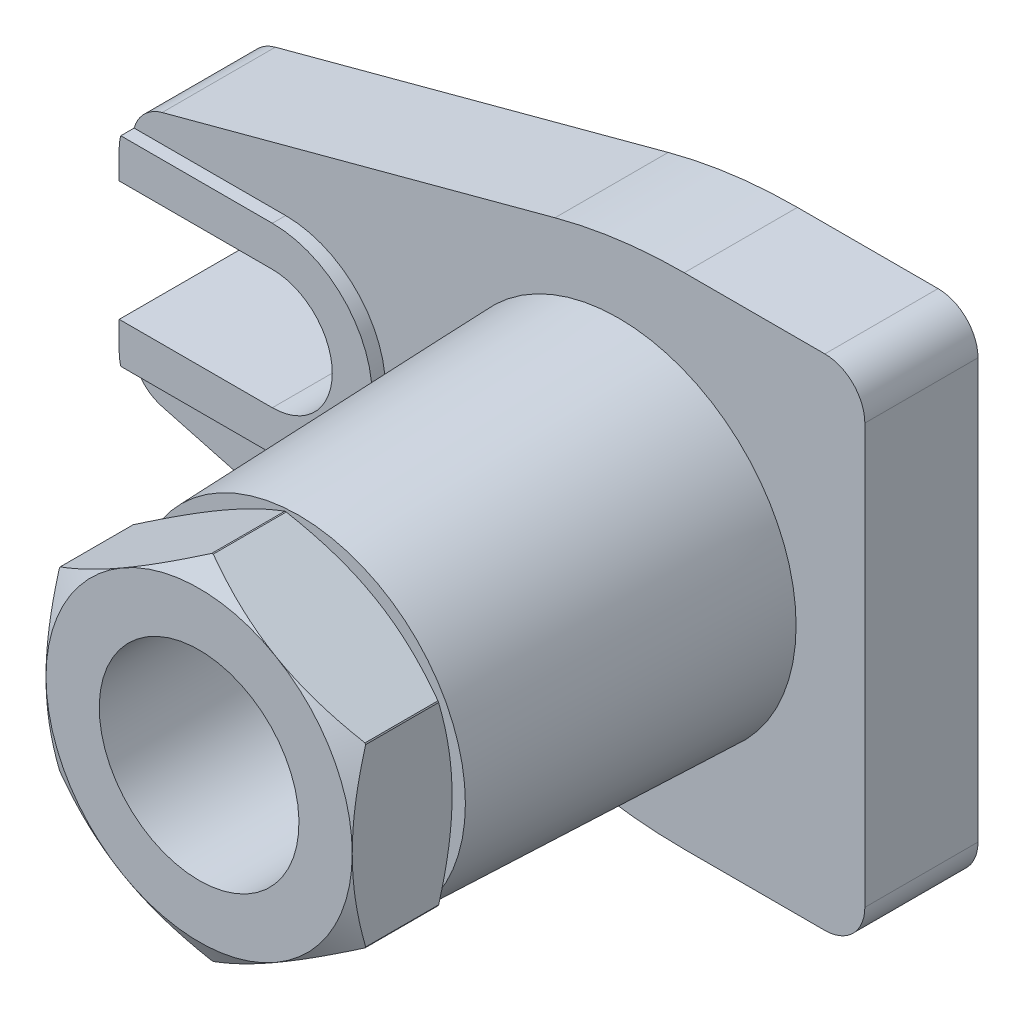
ISO-10303-21;
HEADER;
FILE_DESCRIPTION(('STEP AP214'),'2;1');
FILE_NAME('part.step','',(''),(''),'','','');
FILE_SCHEMA(('AUTOMOTIVE_DESIGN { 1 0 10303 214 1 1 1 1 }'));
ENDSEC;
DATA;
#1=APPLICATION_CONTEXT('core data for automotive mechanical design processes');
#2=APPLICATION_PROTOCOL_DEFINITION('international standard','automotive_design',2000,#1);
#3=PRODUCT_CONTEXT('',#1,'mechanical');
#4=PRODUCT('Part','Part','',(#3));
#5=PRODUCT_RELATED_PRODUCT_CATEGORY('part','',(#4));
#6=PRODUCT_DEFINITION_FORMATION('','',#4);
#7=PRODUCT_DEFINITION_CONTEXT('part definition',#1,'design');
#8=PRODUCT_DEFINITION('design','',#6,#7);
#9=PRODUCT_DEFINITION_SHAPE('','',#8);
#10=(LENGTH_UNIT() NAMED_UNIT(*) SI_UNIT(.MILLI.,.METRE.));
#11=(NAMED_UNIT(*) PLANE_ANGLE_UNIT() SI_UNIT($,.RADIAN.));
#12=(NAMED_UNIT(*) SI_UNIT($,.STERADIAN.) SOLID_ANGLE_UNIT());
#13=UNCERTAINTY_MEASURE_WITH_UNIT(LENGTH_MEASURE(1.E-05),#10,'distance_accuracy_value','');
#14=(GEOMETRIC_REPRESENTATION_CONTEXT(3) GLOBAL_UNCERTAINTY_ASSIGNED_CONTEXT((#13)) GLOBAL_UNIT_ASSIGNED_CONTEXT((#10,
#11,#12)) REPRESENTATION_CONTEXT('',''));
#15=CARTESIAN_POINT('',(0.,0.,0.));
#16=DIRECTION('',(0.,0.,1.));
#17=DIRECTION('',(1.,0.,0.));
#18=AXIS2_PLACEMENT_3D('',#15,#16,#17);
#19=CARTESIAN_POINT('',(0.,0.,19.));
#20=DIRECTION('',(0.,0.,1.));
#21=DIRECTION('',(1.,0.,0.));
#22=AXIS2_PLACEMENT_3D('',#19,#20,#21);
#23=PLANE('',#22);
#24=DIRECTION('',(-1.,0.,0.));
#25=VECTOR('',#24,1.);
#26=CARTESIAN_POINT('',(-23.,15.,19.));
#27=LINE('',#26,#25);
#28=CARTESIAN_POINT('',(0.,15.,19.));
#29=VERTEX_POINT('',#28);
#30=CARTESIAN_POINT('',(-22.7645695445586,15.,19.));
#31=VERTEX_POINT('',#30);
#32=EDGE_CURVE('E611',#29,#31,#27,.T.);
#33=ORIENTED_EDGE('',*,*,#32,.T.);
#34=CARTESIAN_POINT('',(-17.,13.3357470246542,19.));
#35=DIRECTION('',(0.,0.,1.));
#36=DIRECTION('',(1.,0.,0.));
#37=AXIS2_PLACEMENT_3D('',#34,#35,#36);
#38=CIRCLE('',#37,6.);
#39=CARTESIAN_POINT('',(-23.,13.3357470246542,19.));
#40=VERTEX_POINT('',#39);
#41=EDGE_CURVE('E735',#31,#40,#38,.T.);
#42=ORIENTED_EDGE('',*,*,#41,.T.);
#43=DIRECTION('',(0.,-1.,0.));
#44=VECTOR('',#43,1.);
#45=CARTESIAN_POINT('',(-23.,9.,19.));
#46=LINE('',#45,#44);
#47=CARTESIAN_POINT('',(-23.,9.,19.));
#48=VERTEX_POINT('',#47);
#49=EDGE_CURVE('E631',#40,#48,#46,.T.);
#50=ORIENTED_EDGE('',*,*,#49,.T.);
#51=DIRECTION('',(1.,0.,0.));
#52=VECTOR('',#51,1.);
#53=CARTESIAN_POINT('',(0.,9.,19.));
#54=LINE('',#53,#52);
#55=CARTESIAN_POINT('',(0.,9.,19.));
#56=VERTEX_POINT('',#55);
#57=EDGE_CURVE('E634',#48,#56,#54,.T.);
#58=ORIENTED_EDGE('',*,*,#57,.T.);
#59=CARTESIAN_POINT('',(0.,0.,19.));
#60=DIRECTION('',(0.,0.,-1.));
#61=DIRECTION('',(1.,0.,0.));
#62=AXIS2_PLACEMENT_3D('',#59,#60,#61);
#63=CIRCLE('',#62,9.);
#64=CARTESIAN_POINT('',(0.,-9.,19.));
#65=VERTEX_POINT('',#64);
#66=EDGE_CURVE('E637',#56,#65,#63,.T.);
#67=ORIENTED_EDGE('',*,*,#66,.T.);
#68=DIRECTION('',(-1.,0.,0.));
#69=VECTOR('',#68,1.);
#70=CARTESIAN_POINT('',(-23.,-9.,19.));
#71=LINE('',#70,#69);
#72=CARTESIAN_POINT('',(-23.,-9.,19.));
#73=VERTEX_POINT('',#72);
#74=EDGE_CURVE('E640',#65,#73,#71,.T.);
#75=ORIENTED_EDGE('',*,*,#74,.T.);
#76=DIRECTION('',(0.,-1.,0.));
#77=VECTOR('',#76,1.);
#78=CARTESIAN_POINT('',(-23.,-9.,19.));
#79=LINE('',#78,#77);
#80=CARTESIAN_POINT('',(-23.,-13.3357470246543,19.));
#81=VERTEX_POINT('',#80);
#82=EDGE_CURVE('E643',#73,#81,#79,.T.);
#83=ORIENTED_EDGE('',*,*,#82,.T.);
#84=CARTESIAN_POINT('',(-17.,-13.3357470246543,19.));
#85=DIRECTION('',(0.,0.,1.));
#86=DIRECTION('',(1.,0.,0.));
#87=AXIS2_PLACEMENT_3D('',#84,#85,#86);
#88=CIRCLE('',#87,6.);
#89=CARTESIAN_POINT('',(-22.7645695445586,-15.,19.));
#90=VERTEX_POINT('',#89);
#91=EDGE_CURVE('E711',#81,#90,#88,.T.);
#92=ORIENTED_EDGE('',*,*,#91,.T.);
#93=DIRECTION('',(1.,0.,0.));
#94=VECTOR('',#93,1.);
#95=CARTESIAN_POINT('',(0.,-15.,19.));
#96=LINE('',#95,#94);
#97=CARTESIAN_POINT('',(0.,-15.,19.));
#98=VERTEX_POINT('',#97);
#99=EDGE_CURVE('E615',#90,#98,#96,.T.);
#100=ORIENTED_EDGE('',*,*,#99,.T.);
#101=CARTESIAN_POINT('',(0.,0.,19.));
#102=DIRECTION('',(0.,0.,1.));
#103=DIRECTION('',(1.,0.,0.));
#104=AXIS2_PLACEMENT_3D('',#101,#102,#103);
#105=CIRCLE('',#104,15.);
#106=EDGE_CURVE('E608',#98,#29,#105,.T.);
#107=ORIENTED_EDGE('',*,*,#106,.T.);
#108=EDGE_LOOP('',(#33,#42,#50,#58,#67,#75,#83,#92,#100,#107));
#109=FACE_BOUND('',#108,.T.);
#110=ADVANCED_FACE('F14',(#109),#23,.T.);
#111=CARTESIAN_POINT('',(-23.,9.,0.));
#112=DIRECTION('',(-1.,0.,0.));
#113=DIRECTION('',(0.,-1.,0.));
#114=AXIS2_PLACEMENT_3D('',#111,#112,#113);
#115=PLANE('',#114);
#116=ORIENTED_EDGE('',*,*,#49,.F.);
#117=DIRECTION('',(0.,0.,-1.));
#118=VECTOR('',#117,1.);
#119=CARTESIAN_POINT('',(-23.,13.3357470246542,0.));
#120=LINE('',#119,#118);
#121=CARTESIAN_POINT('',(-23.,13.3357470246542,0.));
#122=VERTEX_POINT('',#121);
#123=EDGE_CURVE('E720',#40,#122,#120,.T.);
#124=ORIENTED_EDGE('',*,*,#123,.T.);
#125=DIRECTION('',(0.,1.,0.));
#126=VECTOR('',#125,1.);
#127=CARTESIAN_POINT('',(-23.,0.,0.));
#128=LINE('',#127,#126);
#129=CARTESIAN_POINT('',(-23.,9.,0.));
#130=VERTEX_POINT('',#129);
#131=EDGE_CURVE('E660',#122,#130,#128,.F.);
#132=ORIENTED_EDGE('',*,*,#131,.T.);
#133=DIRECTION('',(0.,0.,1.));
#134=VECTOR('',#133,1.);
#135=CARTESIAN_POINT('',(-23.,9.,0.));
#136=LINE('',#135,#134);
#137=EDGE_CURVE('E682',#48,#130,#136,.F.);
#138=ORIENTED_EDGE('',*,*,#137,.F.);
#139=EDGE_LOOP('',(#116,#124,#132,#138));
#140=FACE_BOUND('',#139,.T.);
#141=ADVANCED_FACE('F513',(#140),#115,.T.);
#142=CARTESIAN_POINT('',(0.,9.,0.));
#143=DIRECTION('',(0.,-1.,0.));
#144=DIRECTION('',(1.,0.,0.));
#145=AXIS2_PLACEMENT_3D('',#142,#143,#144);
#146=PLANE('',#145);
#147=DIRECTION('',(1.,0.,0.));
#148=VECTOR('',#147,1.);
#149=CARTESIAN_POINT('',(50.,9.,0.));
#150=LINE('',#149,#148);
#151=CARTESIAN_POINT('',(0.,9.,0.));
#152=VERTEX_POINT('',#151);
#153=EDGE_CURVE('E657',#130,#152,#150,.T.);
#154=ORIENTED_EDGE('',*,*,#153,.T.);
#155=DIRECTION('',(0.,0.,-1.));
#156=VECTOR('',#155,1.);
#157=CARTESIAN_POINT('',(0.,9.,0.));
#158=LINE('',#157,#156);
#159=EDGE_CURVE('E679',#152,#56,#158,.F.);
#160=ORIENTED_EDGE('',*,*,#159,.T.);
#161=ORIENTED_EDGE('',*,*,#57,.F.);
#162=ORIENTED_EDGE('',*,*,#137,.T.);
#163=EDGE_LOOP('',(#154,#160,#161,#162));
#164=FACE_BOUND('',#163,.T.);
#165=ADVANCED_FACE('F516',(#164),#146,.T.);
#166=CARTESIAN_POINT('',(0.,0.,0.));
#167=DIRECTION('',(0.,0.,-1.));
#168=DIRECTION('',(-1.,0.,0.));
#169=AXIS2_PLACEMENT_3D('',#166,#167,#168);
#170=CYLINDRICAL_SURFACE('',#169,9.);
#171=ORIENTED_EDGE('',*,*,#159,.F.);
#172=CARTESIAN_POINT('',(0.,0.,0.));
#173=DIRECTION('',(0.,0.,-1.));
#174=DIRECTION('',(-1.,0.,0.));
#175=AXIS2_PLACEMENT_3D('',#172,#173,#174);
#176=CIRCLE('',#175,9.);
#177=CARTESIAN_POINT('',(0.,-9.,0.));
#178=VERTEX_POINT('',#177);
#179=EDGE_CURVE('E656',#152,#178,#176,.T.);
#180=ORIENTED_EDGE('',*,*,#179,.T.);
#181=DIRECTION('',(0.,0.,1.));
#182=VECTOR('',#181,1.);
#183=CARTESIAN_POINT('',(0.,-9.,0.));
#184=LINE('',#183,#182);
#185=EDGE_CURVE('E676',#65,#178,#184,.F.);
#186=ORIENTED_EDGE('',*,*,#185,.F.);
#187=ORIENTED_EDGE('',*,*,#66,.F.);
#188=EDGE_LOOP('',(#171,#180,#186,#187));
#189=FACE_BOUND('',#188,.T.);
#190=ADVANCED_FACE('F520',(#189),#170,.F.);
#191=CARTESIAN_POINT('',(-23.,-9.,0.));
#192=DIRECTION('',(0.,1.,0.));
#193=DIRECTION('',(-1.,0.,0.));
#194=AXIS2_PLACEMENT_3D('',#191,#192,#193);
#195=PLANE('',#194);
#196=DIRECTION('',(1.,0.,0.));
#197=VECTOR('',#196,1.);
#198=CARTESIAN_POINT('',(50.,-9.,0.));
#199=LINE('',#198,#197);
#200=CARTESIAN_POINT('',(-23.,-9.,0.));
#201=VERTEX_POINT('',#200);
#202=EDGE_CURVE('E652',#178,#201,#199,.F.);
#203=ORIENTED_EDGE('',*,*,#202,.T.);
#204=DIRECTION('',(0.,0.,1.));
#205=VECTOR('',#204,1.);
#206=CARTESIAN_POINT('',(-23.,-9.,0.));
#207=LINE('',#206,#205);
#208=EDGE_CURVE('E672',#73,#201,#207,.F.);
#209=ORIENTED_EDGE('',*,*,#208,.F.);
#210=ORIENTED_EDGE('',*,*,#74,.F.);
#211=ORIENTED_EDGE('',*,*,#185,.T.);
#212=EDGE_LOOP('',(#203,#209,#210,#211));
#213=FACE_BOUND('',#212,.T.);
#214=ADVANCED_FACE('F524',(#213),#195,.T.);
#215=CARTESIAN_POINT('',(-23.,-17.9397089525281,0.));
#216=DIRECTION('',(-1.,0.,0.));
#217=DIRECTION('',(0.,-1.,0.));
#218=AXIS2_PLACEMENT_3D('',#215,#216,#217);
#219=PLANE('',#218);
#220=DIRECTION('',(0.,1.,0.));
#221=VECTOR('',#220,1.);
#222=CARTESIAN_POINT('',(-23.,0.,0.));
#223=LINE('',#222,#221);
#224=CARTESIAN_POINT('',(-23.,-13.3357470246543,0.));
#225=VERTEX_POINT('',#224);
#226=EDGE_CURVE('E655',#201,#225,#223,.F.);
#227=ORIENTED_EDGE('',*,*,#226,.T.);
#228=DIRECTION('',(0.,0.,-1.));
#229=VECTOR('',#228,1.);
#230=CARTESIAN_POINT('',(-23.,-13.3357470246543,0.));
#231=LINE('',#230,#229);
#232=EDGE_CURVE('E708',#225,#81,#231,.F.);
#233=ORIENTED_EDGE('',*,*,#232,.T.);
#234=ORIENTED_EDGE('',*,*,#82,.F.);
#235=ORIENTED_EDGE('',*,*,#208,.T.);
#236=EDGE_LOOP('',(#227,#233,#234,#235));
#237=FACE_BOUND('',#236,.T.);
#238=ADVANCED_FACE('F528',(#237),#219,.T.);
#239=CARTESIAN_POINT('',(81.,31.5,0.));
#240=DIRECTION('',(0.,0.,1.));
#241=DIRECTION('',(1.,0.,0.));
#242=AXIS2_PLACEMENT_3D('',#239,#240,#241);
#243=CYLINDRICAL_SURFACE('',#242,6.);
#244=CARTESIAN_POINT('',(81.,31.5,17.));
#245=DIRECTION('',(0.,0.,1.));
#246=DIRECTION('',(-1.,0.,0.));
#247=AXIS2_PLACEMENT_3D('',#244,#245,#246);
#248=CIRCLE('',#247,6.);
#249=CARTESIAN_POINT('',(87.,31.5,17.));
#250=VERTEX_POINT('',#249);
#251=CARTESIAN_POINT('',(81.,37.5,17.));
#252=VERTEX_POINT('',#251);
#253=EDGE_CURVE('E430',#250,#252,#248,.T.);
#254=ORIENTED_EDGE('',*,*,#253,.F.);
#255=DIRECTION('',(0.,0.,1.));
#256=VECTOR('',#255,1.);
#257=CARTESIAN_POINT('',(87.,31.5,0.));
#258=LINE('',#257,#256);
#259=CARTESIAN_POINT('',(87.,31.5,0.));
#260=VERTEX_POINT('',#259);
#261=EDGE_CURVE('E587',#260,#250,#258,.T.);
#262=ORIENTED_EDGE('',*,*,#261,.F.);
#263=CARTESIAN_POINT('',(81.,31.5,0.));
#264=DIRECTION('',(0.,0.,1.));
#265=DIRECTION('',(-1.,0.,0.));
#266=AXIS2_PLACEMENT_3D('',#263,#264,#265);
#267=CIRCLE('',#266,6.);
#268=CARTESIAN_POINT('',(81.,37.5,0.));
#269=VERTEX_POINT('',#268);
#270=EDGE_CURVE('E584',#260,#269,#267,.T.);
#271=ORIENTED_EDGE('',*,*,#270,.T.);
#272=DIRECTION('',(0.,0.,1.));
#273=VECTOR('',#272,1.);
#274=CARTESIAN_POINT('',(81.,37.5,0.));
#275=LINE('',#274,#273);
#276=EDGE_CURVE('E590',#269,#252,#275,.T.);
#277=ORIENTED_EDGE('',*,*,#276,.T.);
#278=EDGE_LOOP('',(#254,#262,#271,#277));
#279=FACE_BOUND('',#278,.T.);
#280=ADVANCED_FACE('F505',(#279),#243,.T.);
#281=CARTESIAN_POINT('',(87.,27.5,0.));
#282=DIRECTION('',(1.,0.,0.));
#283=DIRECTION('',(0.,1.,0.));
#284=AXIS2_PLACEMENT_3D('',#281,#282,#283);
#285=PLANE('',#284);
#286=DIRECTION('',(0.,1.,0.));
#287=VECTOR('',#286,1.);
#288=CARTESIAN_POINT('',(87.,0.,0.));
#289=LINE('',#288,#287);
#290=CARTESIAN_POINT('',(87.,-31.5,0.));
#291=VERTEX_POINT('',#290);
#292=EDGE_CURVE('E665',#291,#260,#289,.T.);
#293=ORIENTED_EDGE('',*,*,#292,.T.);
#294=ORIENTED_EDGE('',*,*,#261,.T.);
#295=DIRECTION('',(0.,1.,0.));
#296=VECTOR('',#295,1.);
#297=CARTESIAN_POINT('',(87.,27.5,17.));
#298=LINE('',#297,#296);
#299=CARTESIAN_POINT('',(87.,-31.5,17.));
#300=VERTEX_POINT('',#299);
#301=EDGE_CURVE('E646',#250,#300,#298,.F.);
#302=ORIENTED_EDGE('',*,*,#301,.T.);
#303=DIRECTION('',(0.,0.,1.));
#304=VECTOR('',#303,1.);
#305=CARTESIAN_POINT('',(87.,-31.5,0.));
#306=LINE('',#305,#304);
#307=EDGE_CURVE('E602',#291,#300,#306,.T.);
#308=ORIENTED_EDGE('',*,*,#307,.F.);
#309=EDGE_LOOP('',(#293,#294,#302,#308));
#310=FACE_BOUND('',#309,.T.);
#311=ADVANCED_FACE('F501',(#310),#285,.T.);
#312=CARTESIAN_POINT('',(81.,-31.5,0.));
#313=DIRECTION('',(0.,0.,1.));
#314=DIRECTION('',(1.,0.,0.));
#315=AXIS2_PLACEMENT_3D('',#312,#313,#314);
#316=CYLINDRICAL_SURFACE('',#315,6.);
#317=CARTESIAN_POINT('',(81.,-31.5,17.));
#318=DIRECTION('',(0.,0.,1.));
#319=DIRECTION('',(1.,0.,0.));
#320=AXIS2_PLACEMENT_3D('',#317,#318,#319);
#321=CIRCLE('',#320,6.);
#322=CARTESIAN_POINT('',(81.,-37.5,17.));
#323=VERTEX_POINT('',#322);
#324=EDGE_CURVE('E593',#323,#300,#321,.T.);
#325=ORIENTED_EDGE('',*,*,#324,.F.);
#326=DIRECTION('',(0.,0.,1.));
#327=VECTOR('',#326,1.);
#328=CARTESIAN_POINT('',(81.,-37.5,0.));
#329=LINE('',#328,#327);
#330=CARTESIAN_POINT('',(81.,-37.5,0.));
#331=VERTEX_POINT('',#330);
#332=EDGE_CURVE('E599',#331,#323,#329,.T.);
#333=ORIENTED_EDGE('',*,*,#332,.F.);
#334=CARTESIAN_POINT('',(81.,-31.5,0.));
#335=DIRECTION('',(0.,0.,1.));
#336=DIRECTION('',(1.,0.,0.));
#337=AXIS2_PLACEMENT_3D('',#334,#335,#336);
#338=CIRCLE('',#337,6.);
#339=EDGE_CURVE('E596',#331,#291,#338,.T.);
#340=ORIENTED_EDGE('',*,*,#339,.T.);
#341=ORIENTED_EDGE('',*,*,#307,.T.);
#342=EDGE_LOOP('',(#325,#333,#340,#341));
#343=FACE_BOUND('',#342,.T.);
#344=ADVANCED_FACE('F504',(#343),#316,.T.);
#345=CARTESIAN_POINT('',(77.,-37.5,0.));
#346=DIRECTION('',(0.,-1.,0.));
#347=DIRECTION('',(1.,0.,0.));
#348=AXIS2_PLACEMENT_3D('',#345,#346,#347);
#349=PLANE('',#348);
#350=DIRECTION('',(1.,0.,0.));
#351=VECTOR('',#350,1.);
#352=CARTESIAN_POINT('',(77.,-37.5,17.));
#353=LINE('',#352,#351);
#354=CARTESIAN_POINT('',(59.8739373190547,-37.5,17.));
#355=VERTEX_POINT('',#354);
#356=EDGE_CURVE('E668',#323,#355,#353,.F.);
#357=ORIENTED_EDGE('',*,*,#356,.T.);
#358=DIRECTION('',(0.,0.,1.));
#359=VECTOR('',#358,1.);
#360=CARTESIAN_POINT('',(59.8739373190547,-37.5,0.));
#361=LINE('',#360,#359);
#362=CARTESIAN_POINT('',(59.8739373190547,-37.5,0.));
#363=VERTEX_POINT('',#362);
#364=EDGE_CURVE('E25',#355,#363,#361,.F.);
#365=ORIENTED_EDGE('',*,*,#364,.T.);
#366=DIRECTION('',(1.,0.,0.));
#367=VECTOR('',#366,1.);
#368=CARTESIAN_POINT('',(50.,-37.5,0.));
#369=LINE('',#368,#367);
#370=EDGE_CURVE('E647',#363,#331,#369,.T.);
#371=ORIENTED_EDGE('',*,*,#370,.T.);
#372=ORIENTED_EDGE('',*,*,#332,.T.);
#373=EDGE_LOOP('',(#357,#365,#371,#372));
#374=FACE_BOUND('',#373,.T.);
#375=ADVANCED_FACE('F479',(#374),#349,.T.);
#376=CARTESIAN_POINT('',(59.8739373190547,37.5,0.));
#377=DIRECTION('',(0.,0.,1.));
#378=DIRECTION('',(1.,0.,0.));
#379=AXIS2_PLACEMENT_3D('',#376,#377,#378);
#380=CYLINDRICAL_SURFACE('',#379,75.);
#381=CARTESIAN_POINT('',(59.8739373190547,37.5,0.));
#382=DIRECTION('',(0.,0.,1.));
#383=DIRECTION('',(1.,0.,0.));
#384=AXIS2_PLACEMENT_3D('',#381,#382,#383);
#385=CIRCLE('',#384,75.);
#386=CARTESIAN_POINT('',(40.4625089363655,-34.9444369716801,0.));
#387=VERTEX_POINT('',#386);
#388=EDGE_CURVE('E34',#363,#387,#385,.F.);
#389=ORIENTED_EDGE('',*,*,#388,.F.);
#390=ORIENTED_EDGE('',*,*,#364,.F.);
#391=CARTESIAN_POINT('',(59.8739373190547,37.5,17.));
#392=DIRECTION('',(0.,0.,1.));
#393=DIRECTION('',(1.,0.,0.));
#394=AXIS2_PLACEMENT_3D('',#391,#392,#393);
#395=CIRCLE('',#394,75.);
#396=CARTESIAN_POINT('',(40.4625089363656,-34.9444369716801,17.));
#397=VERTEX_POINT('',#396);
#398=EDGE_CURVE('E741',#397,#355,#395,.T.);
#399=ORIENTED_EDGE('',*,*,#398,.F.);
#400=DIRECTION('',(0.,0.,1.));
#401=VECTOR('',#400,1.);
#402=CARTESIAN_POINT('',(40.4625089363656,-34.9444369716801,0.));
#403=LINE('',#402,#401);
#404=EDGE_CURVE('E754',#387,#397,#403,.T.);
#405=ORIENTED_EDGE('',*,*,#404,.F.);
#406=EDGE_LOOP('',(#389,#390,#399,#405));
#407=FACE_BOUND('',#406,.T.);
#408=ADVANCED_FACE('F475',(#407),#380,.T.);
#409=CARTESIAN_POINT('',(50.,-37.5,0.));
#410=DIRECTION('',(-0.258819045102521,-0.965925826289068,0.));
#411=DIRECTION('',(0.965925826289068,-0.258819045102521,0.));
#412=AXIS2_PLACEMENT_3D('',#409,#410,#411);
#413=PLANE('',#412);
#414=DIRECTION('',(0.965925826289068,-0.25881904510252,0.));
#415=VECTOR('',#414,1.);
#416=CARTESIAN_POINT('',(-23.,-17.9397089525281,0.));
#417=LINE('',#416,#415);
#418=CARTESIAN_POINT('',(-18.5529142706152,-19.1313019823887,0.));
#419=VERTEX_POINT('',#418);
#420=EDGE_CURVE('E651',#419,#387,#417,.T.);
#421=ORIENTED_EDGE('',*,*,#420,.T.);
#422=ORIENTED_EDGE('',*,*,#404,.T.);
#423=DIRECTION('',(0.965925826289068,-0.258819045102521,0.));
#424=VECTOR('',#423,1.);
#425=CARTESIAN_POINT('',(50.,-37.5,17.));
#426=LINE('',#425,#424);
#427=CARTESIAN_POINT('',(-18.5529142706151,-19.1313019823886,17.));
#428=VERTEX_POINT('',#427);
#429=EDGE_CURVE('E675',#397,#428,#426,.F.);
#430=ORIENTED_EDGE('',*,*,#429,.T.);
#431=DIRECTION('',(0.,0.,-1.));
#432=VECTOR('',#431,1.);
#433=CARTESIAN_POINT('',(-18.5529142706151,-19.1313019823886,0.));
#434=LINE('',#433,#432);
#435=EDGE_CURVE('E650',#428,#419,#434,.T.);
#436=ORIENTED_EDGE('',*,*,#435,.T.);
#437=EDGE_LOOP('',(#421,#422,#430,#436));
#438=FACE_BOUND('',#437,.T.);
#439=ADVANCED_FACE('F478',(#438),#413,.T.);
#440=CARTESIAN_POINT('',(-17.,-13.3357470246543,0.));
#441=DIRECTION('',(0.,0.,-1.));
#442=DIRECTION('',(-1.,0.,0.));
#443=AXIS2_PLACEMENT_3D('',#440,#441,#442);
#444=CYLINDRICAL_SURFACE('',#443,6.);
#445=ORIENTED_EDGE('',*,*,#91,.F.);
#446=ORIENTED_EDGE('',*,*,#232,.F.);
#447=CARTESIAN_POINT('',(-17.,-13.3357470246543,0.));
#448=DIRECTION('',(0.,0.,1.));
#449=DIRECTION('',(1.,0.,0.));
#450=AXIS2_PLACEMENT_3D('',#447,#448,#449);
#451=CIRCLE('',#450,6.);
#452=EDGE_CURVE('E705',#419,#225,#451,.F.);
#453=ORIENTED_EDGE('',*,*,#452,.F.);
#454=ORIENTED_EDGE('',*,*,#435,.F.);
#455=CARTESIAN_POINT('',(-17.,-13.3357470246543,17.));
#456=DIRECTION('',(0.,0.,1.));
#457=DIRECTION('',(1.,0.,0.));
#458=AXIS2_PLACEMENT_3D('',#455,#456,#457);
#459=CIRCLE('',#458,6.);
#460=CARTESIAN_POINT('',(-22.7645695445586,-15.,17.));
#461=VERTEX_POINT('',#460);
#462=EDGE_CURVE('E717',#461,#428,#459,.T.);
#463=ORIENTED_EDGE('',*,*,#462,.F.);
#464=DIRECTION('',(0.,0.,-1.));
#465=VECTOR('',#464,1.);
#466=CARTESIAN_POINT('',(-22.7645695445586,-15.,19.));
#467=LINE('',#466,#465);
#468=EDGE_CURVE('E714',#90,#461,#467,.T.);
#469=ORIENTED_EDGE('',*,*,#468,.F.);
#470=EDGE_LOOP('',(#445,#446,#453,#454,#463,#469));
#471=FACE_BOUND('',#470,.T.);
#472=ADVANCED_FACE('F492',(#471),#444,.T.);
#473=CARTESIAN_POINT('',(0.,-15.,19.));
#474=DIRECTION('',(0.,1.,0.));
#475=DIRECTION('',(-1.,0.,0.));
#476=AXIS2_PLACEMENT_3D('',#473,#474,#475);
#477=PLANE('',#476);
#478=ORIENTED_EDGE('',*,*,#99,.F.);
#479=ORIENTED_EDGE('',*,*,#468,.T.);
#480=DIRECTION('',(1.,0.,0.));
#481=VECTOR('',#480,1.);
#482=CARTESIAN_POINT('',(0.,-15.,17.));
#483=LINE('',#482,#481);
#484=CARTESIAN_POINT('',(0.,-15.,17.));
#485=VERTEX_POINT('',#484);
#486=EDGE_CURVE('E612',#461,#485,#483,.T.);
#487=ORIENTED_EDGE('',*,*,#486,.T.);
#488=DIRECTION('',(0.,0.,-1.));
#489=VECTOR('',#488,1.);
#490=CARTESIAN_POINT('',(0.,-15.,19.));
#491=LINE('',#490,#489);
#492=EDGE_CURVE('E618',#98,#485,#491,.T.);
#493=ORIENTED_EDGE('',*,*,#492,.F.);
#494=EDGE_LOOP('',(#478,#479,#487,#493));
#495=FACE_BOUND('',#494,.T.);
#496=ADVANCED_FACE('F495',(#495),#477,.F.);
#497=CARTESIAN_POINT('',(0.,0.,19.));
#498=DIRECTION('',(0.,0.,-1.));
#499=DIRECTION('',(-1.,0.,0.));
#500=AXIS2_PLACEMENT_3D('',#497,#498,#499);
#501=CYLINDRICAL_SURFACE('',#500,15.);
#502=CARTESIAN_POINT('',(0.,0.,17.));
#503=DIRECTION('',(0.,0.,1.));
#504=DIRECTION('',(1.,0.,0.));
#505=AXIS2_PLACEMENT_3D('',#502,#503,#504);
#506=CIRCLE('',#505,15.);
#507=CARTESIAN_POINT('',(0.,15.,17.));
#508=VERTEX_POINT('',#507);
#509=EDGE_CURVE('E605',#485,#508,#506,.T.);
#510=ORIENTED_EDGE('',*,*,#509,.T.);
#511=DIRECTION('',(0.,0.,-1.));
#512=VECTOR('',#511,1.);
#513=CARTESIAN_POINT('',(0.,15.,19.));
#514=LINE('',#513,#512);
#515=EDGE_CURVE('E628',#29,#508,#514,.T.);
#516=ORIENTED_EDGE('',*,*,#515,.F.);
#517=ORIENTED_EDGE('',*,*,#106,.F.);
#518=ORIENTED_EDGE('',*,*,#492,.T.);
#519=EDGE_LOOP('',(#510,#516,#517,#518));
#520=FACE_BOUND('',#519,.T.);
#521=ADVANCED_FACE('F546',(#520),#501,.T.);
#522=CARTESIAN_POINT('',(-23.,15.,19.));
#523=DIRECTION('',(0.,-1.,0.));
#524=DIRECTION('',(1.,0.,0.));
#525=AXIS2_PLACEMENT_3D('',#522,#523,#524);
#526=PLANE('',#525);
#527=DIRECTION('',(-1.,0.,0.));
#528=VECTOR('',#527,1.);
#529=CARTESIAN_POINT('',(-23.,15.,17.));
#530=LINE('',#529,#528);
#531=CARTESIAN_POINT('',(-22.7645695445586,15.,17.));
#532=VERTEX_POINT('',#531);
#533=EDGE_CURVE('E621',#508,#532,#530,.T.);
#534=ORIENTED_EDGE('',*,*,#533,.T.);
#535=DIRECTION('',(0.,0.,-1.));
#536=VECTOR('',#535,1.);
#537=CARTESIAN_POINT('',(-22.7645695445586,15.,17.));
#538=LINE('',#537,#536);
#539=EDGE_CURVE('E732',#532,#31,#538,.F.);
#540=ORIENTED_EDGE('',*,*,#539,.T.);
#541=ORIENTED_EDGE('',*,*,#32,.F.);
#542=ORIENTED_EDGE('',*,*,#515,.T.);
#543=EDGE_LOOP('',(#534,#540,#541,#542));
#544=FACE_BOUND('',#543,.T.);
#545=ADVANCED_FACE('F490',(#544),#526,.F.);
#546=CARTESIAN_POINT('',(-17.,13.3357470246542,0.));
#547=DIRECTION('',(0.,0.,-1.));
#548=DIRECTION('',(-1.,0.,0.));
#549=AXIS2_PLACEMENT_3D('',#546,#547,#548);
#550=CYLINDRICAL_SURFACE('',#549,6.);
#551=CARTESIAN_POINT('',(-17.,13.3357470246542,17.));
#552=DIRECTION('',(0.,0.,1.));
#553=DIRECTION('',(1.,0.,0.));
#554=AXIS2_PLACEMENT_3D('',#551,#552,#553);
#555=CIRCLE('',#554,6.);
#556=CARTESIAN_POINT('',(-18.5529142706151,19.1313019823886,17.));
#557=VERTEX_POINT('',#556);
#558=EDGE_CURVE('E729',#557,#532,#555,.T.);
#559=ORIENTED_EDGE('',*,*,#558,.F.);
#560=DIRECTION('',(0.,0.,-1.));
#561=VECTOR('',#560,1.);
#562=CARTESIAN_POINT('',(-18.5529142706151,19.1313019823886,0.));
#563=LINE('',#562,#561);
#564=CARTESIAN_POINT('',(-18.5529142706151,19.1313019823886,0.));
#565=VERTEX_POINT('',#564);
#566=EDGE_CURVE('E726',#565,#557,#563,.F.);
#567=ORIENTED_EDGE('',*,*,#566,.F.);
#568=CARTESIAN_POINT('',(-17.,13.3357470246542,0.));
#569=DIRECTION('',(0.,0.,1.));
#570=DIRECTION('',(1.,0.,0.));
#571=AXIS2_PLACEMENT_3D('',#568,#569,#570);
#572=CIRCLE('',#571,6.);
#573=EDGE_CURVE('E723',#122,#565,#572,.F.);
#574=ORIENTED_EDGE('',*,*,#573,.F.);
#575=ORIENTED_EDGE('',*,*,#123,.F.);
#576=ORIENTED_EDGE('',*,*,#41,.F.);
#577=ORIENTED_EDGE('',*,*,#539,.F.);
#578=EDGE_LOOP('',(#559,#567,#574,#575,#576,#577));
#579=FACE_BOUND('',#578,.T.);
#580=ADVANCED_FACE('F487',(#579),#550,.T.);
#581=CARTESIAN_POINT('',(-23.,17.939708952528,0.));
#582=DIRECTION('',(-0.258819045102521,0.965925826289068,0.));
#583=DIRECTION('',(-0.965925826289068,-0.258819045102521,0.));
#584=AXIS2_PLACEMENT_3D('',#581,#582,#583);
#585=PLANE('',#584);
#586=DIRECTION('',(-0.965925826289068,-0.258819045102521,0.));
#587=VECTOR('',#586,1.);
#588=CARTESIAN_POINT('',(-23.,17.939708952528,17.));
#589=LINE('',#588,#587);
#590=CARTESIAN_POINT('',(40.4625089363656,34.9444369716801,17.));
#591=VERTEX_POINT('',#590);
#592=EDGE_CURVE('E685',#557,#591,#589,.F.);
#593=ORIENTED_EDGE('',*,*,#592,.T.);
#594=DIRECTION('',(0.,0.,1.));
#595=VECTOR('',#594,1.);
#596=CARTESIAN_POINT('',(40.4625089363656,34.9444369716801,0.));
#597=LINE('',#596,#595);
#598=CARTESIAN_POINT('',(40.4625089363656,34.9444369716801,0.));
#599=VERTEX_POINT('',#598);
#600=EDGE_CURVE('E747',#591,#599,#597,.F.);
#601=ORIENTED_EDGE('',*,*,#600,.T.);
#602=DIRECTION('',(-0.965925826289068,-0.258819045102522,0.));
#603=VECTOR('',#602,1.);
#604=CARTESIAN_POINT('',(50.,37.5,0.));
#605=LINE('',#604,#603);
#606=EDGE_CURVE('E664',#599,#565,#605,.T.);
#607=ORIENTED_EDGE('',*,*,#606,.T.);
#608=ORIENTED_EDGE('',*,*,#566,.T.);
#609=EDGE_LOOP('',(#593,#601,#607,#608));
#610=FACE_BOUND('',#609,.T.);
#611=ADVANCED_FACE('F485',(#610),#585,.T.);
#612=CARTESIAN_POINT('',(59.8739373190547,-37.5,0.));
#613=DIRECTION('',(0.,0.,1.));
#614=DIRECTION('',(1.,0.,0.));
#615=AXIS2_PLACEMENT_3D('',#612,#613,#614);
#616=CYLINDRICAL_SURFACE('',#615,75.);
#617=CARTESIAN_POINT('',(59.8739373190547,-37.5,0.));
#618=DIRECTION('',(0.,0.,1.));
#619=DIRECTION('',(1.,0.,0.));
#620=AXIS2_PLACEMENT_3D('',#617,#618,#619);
#621=CIRCLE('',#620,75.);
#622=CARTESIAN_POINT('',(59.8739373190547,37.5,0.));
#623=VERTEX_POINT('',#622);
#624=EDGE_CURVE('E751',#599,#623,#621,.F.);
#625=ORIENTED_EDGE('',*,*,#624,.F.);
#626=ORIENTED_EDGE('',*,*,#600,.F.);
#627=CARTESIAN_POINT('',(59.8739373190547,-37.5,17.));
#628=DIRECTION('',(0.,0.,1.));
#629=DIRECTION('',(1.,0.,0.));
#630=AXIS2_PLACEMENT_3D('',#627,#628,#629);
#631=CIRCLE('',#630,75.);
#632=CARTESIAN_POINT('',(59.8739373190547,37.5,17.));
#633=VERTEX_POINT('',#632);
#634=EDGE_CURVE('E744',#633,#591,#631,.T.);
#635=ORIENTED_EDGE('',*,*,#634,.F.);
#636=DIRECTION('',(0.,0.,1.));
#637=VECTOR('',#636,1.);
#638=CARTESIAN_POINT('',(59.8739373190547,37.5,0.));
#639=LINE('',#638,#637);
#640=EDGE_CURVE('E738',#623,#633,#639,.T.);
#641=ORIENTED_EDGE('',*,*,#640,.F.);
#642=EDGE_LOOP('',(#625,#626,#635,#641));
#643=FACE_BOUND('',#642,.T.);
#644=ADVANCED_FACE('F481',(#643),#616,.T.);
#645=CARTESIAN_POINT('',(50.,37.5,0.));
#646=DIRECTION('',(0.,1.,0.));
#647=DIRECTION('',(-1.,0.,0.));
#648=AXIS2_PLACEMENT_3D('',#645,#646,#647);
#649=PLANE('',#648);
#650=DIRECTION('',(1.,0.,0.));
#651=VECTOR('',#650,1.);
#652=CARTESIAN_POINT('',(50.,37.5,0.));
#653=LINE('',#652,#651);
#654=EDGE_CURVE('E661',#269,#623,#653,.F.);
#655=ORIENTED_EDGE('',*,*,#654,.T.);
#656=ORIENTED_EDGE('',*,*,#640,.T.);
#657=DIRECTION('',(-1.,0.,0.));
#658=VECTOR('',#657,1.);
#659=CARTESIAN_POINT('',(50.,37.5,17.));
#660=LINE('',#659,#658);
#661=EDGE_CURVE('E696',#633,#252,#660,.F.);
#662=ORIENTED_EDGE('',*,*,#661,.T.);
#663=ORIENTED_EDGE('',*,*,#276,.F.);
#664=EDGE_LOOP('',(#655,#656,#662,#663));
#665=FACE_BOUND('',#664,.T.);
#666=ADVANCED_FACE('F484',(#665),#649,.T.);
#667=CARTESIAN_POINT('',(50.,0.,17.));
#668=DIRECTION('',(0.,0.,1.));
#669=DIRECTION('',(1.,0.,0.));
#670=AXIS2_PLACEMENT_3D('',#667,#668,#669);
#671=PLANE('',#670);
#672=CARTESIAN_POINT('',(50.,0.,17.));
#673=DIRECTION('',(0.,0.,1.));
#674=DIRECTION('',(1.,0.,0.));
#675=AXIS2_PLACEMENT_3D('',#672,#673,#674);
#676=CIRCLE('',#675,26.676196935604);
#677=CARTESIAN_POINT('',(76.676196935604,0.,17.));
#678=VERTEX_POINT('',#677);
#679=EDGE_CURVE('E9',#678,#678,#676,.T.);
#680=ORIENTED_EDGE('',*,*,#679,.F.);
#681=EDGE_LOOP('',(#680));
#682=FACE_BOUND('',#681,.T.);
#683=ORIENTED_EDGE('',*,*,#661,.F.);
#684=ORIENTED_EDGE('',*,*,#634,.T.);
#685=ORIENTED_EDGE('',*,*,#592,.F.);
#686=ORIENTED_EDGE('',*,*,#558,.T.);
#687=ORIENTED_EDGE('',*,*,#533,.F.);
#688=ORIENTED_EDGE('',*,*,#509,.F.);
#689=ORIENTED_EDGE('',*,*,#486,.F.);
#690=ORIENTED_EDGE('',*,*,#462,.T.);
#691=ORIENTED_EDGE('',*,*,#429,.F.);
#692=ORIENTED_EDGE('',*,*,#398,.T.);
#693=ORIENTED_EDGE('',*,*,#356,.F.);
#694=ORIENTED_EDGE('',*,*,#324,.T.);
#695=ORIENTED_EDGE('',*,*,#301,.F.);
#696=ORIENTED_EDGE('',*,*,#253,.T.);
#697=EDGE_LOOP('',(#683,#684,#685,#686,#687,#688,#689,#690,#691,#692,#693,#694,#695,#696));
#698=FACE_BOUND('',#697,.T.);
#699=ADVANCED_FACE('F497',(#682,#698),#671,.T.);
#700=CARTESIAN_POINT('',(50.,0.,0.));
#701=DIRECTION('',(0.,0.,1.));
#702=DIRECTION('',(1.,0.,0.));
#703=AXIS2_PLACEMENT_3D('',#700,#701,#702);
#704=PLANE('',#703);
#705=CARTESIAN_POINT('',(49.99927388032,-0.190539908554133,0.));
#706=DIRECTION('',(0.,0.,1.));
#707=DIRECTION('',(1.,0.,0.));
#708=AXIS2_PLACEMENT_3D('',#705,#706,#707);
#709=CIRCLE('',#708,20.);
#710=CARTESIAN_POINT('',(69.99927388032,-0.190539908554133,0.));
#711=VERTEX_POINT('',#710);
#712=EDGE_CURVE('E575',#711,#711,#709,.T.);
#713=ORIENTED_EDGE('',*,*,#712,.T.);
#714=EDGE_LOOP('',(#713));
#715=FACE_BOUND('',#714,.T.);
#716=ORIENTED_EDGE('',*,*,#606,.F.);
#717=ORIENTED_EDGE('',*,*,#624,.T.);
#718=ORIENTED_EDGE('',*,*,#654,.F.);
#719=ORIENTED_EDGE('',*,*,#270,.F.);
#720=ORIENTED_EDGE('',*,*,#292,.F.);
#721=ORIENTED_EDGE('',*,*,#339,.F.);
#722=ORIENTED_EDGE('',*,*,#370,.F.);
#723=ORIENTED_EDGE('',*,*,#388,.T.);
#724=ORIENTED_EDGE('',*,*,#420,.F.);
#725=ORIENTED_EDGE('',*,*,#452,.T.);
#726=ORIENTED_EDGE('',*,*,#226,.F.);
#727=ORIENTED_EDGE('',*,*,#202,.F.);
#728=ORIENTED_EDGE('',*,*,#179,.F.);
#729=ORIENTED_EDGE('',*,*,#153,.F.);
#730=ORIENTED_EDGE('',*,*,#131,.F.);
#731=ORIENTED_EDGE('',*,*,#573,.T.);
#732=EDGE_LOOP('',(#716,#717,#718,#719,#720,#721,#722,#723,#724,#725,#726,#727,#728,#729,#730,#731));
#733=FACE_BOUND('',#732,.T.);
#734=ADVANCED_FACE('F469',(#715,#733),#704,.F.);
#735=CARTESIAN_POINT('',(50.,0.,77.9792740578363));
#736=DIRECTION('',(0.,0.,-1.));
#737=DIRECTION('',(0.,1.,0.));
#738=AXIS2_PLACEMENT_3D('',#735,#736,#737);
#739=CONICAL_SURFACE('',#738,26.5,1.0471975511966);
#740=CARTESIAN_POINT('',(38.5,-19.9185842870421,80.));
#741=CARTESIAN_POINT('',(38.7418459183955,-20.0582140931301,80.000004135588));
#742=CARTESIAN_POINT('',(38.9836844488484,-20.1978396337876,79.9970629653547));
#743=CARTESIAN_POINT('',(39.4672516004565,-20.4770272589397,79.9853277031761));
#744=CARTESIAN_POINT('',(39.7089802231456,-20.6165893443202,79.9765336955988));
#745=CARTESIAN_POINT('',(40.4337536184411,-21.0350374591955,79.9414344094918));
#746=CARTESIAN_POINT('',(40.9165014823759,-21.313752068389,79.9064118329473));
#747=CARTESIAN_POINT('',(41.8779742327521,-21.8688586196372,79.8141154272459));
#748=CARTESIAN_POINT('',(42.3567072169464,-22.1452552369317,79.756952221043));
#749=CARTESIAN_POINT('',(43.3119349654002,-22.6967562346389,79.6215488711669));
#750=CARTESIAN_POINT('',(43.7884296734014,-22.9718605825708,79.5433082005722));
#751=CARTESIAN_POINT('',(44.7381215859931,-23.5201654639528,79.367329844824));
#752=CARTESIAN_POINT('',(45.2113219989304,-23.7933678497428,79.269615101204));
#753=CARTESIAN_POINT('',(46.1546987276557,-24.3380266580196,79.0562654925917));
#754=CARTESIAN_POINT('',(46.6248748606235,-24.6094829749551,78.9406295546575));
#755=CARTESIAN_POINT('',(47.5643681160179,-25.1518996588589,78.6925219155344));
#756=CARTESIAN_POINT('',(48.0336688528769,-25.4228505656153,78.5599679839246));
#757=CARTESIAN_POINT('',(48.968869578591,-25.9627889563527,78.2801996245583));
#758=CARTESIAN_POINT('',(49.4347703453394,-26.2317768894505,78.1329886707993));
#759=CARTESIAN_POINT('',(49.899013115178,-26.4998075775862,77.9792740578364));
#760=B_SPLINE_CURVE_WITH_KNOTS('',3,(#740,#741,#742,#743,#744,#745,#746,#747,#748,#749,#750,
#751,#752,#753,#754,#755,#756,#757,#758,#759),.UNSPECIFIED.,.F.,.F.,(4,2,2,2,2,2,2,2,2,4),(0.,
0.837746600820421,1.67548112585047,3.35055016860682,5.01735570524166,6.68420291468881,
8.34909797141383,10.0140927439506,11.6875126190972,13.3605368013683),.UNSPECIFIED.);
#761=CARTESIAN_POINT('',(38.5,-19.9185842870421,80.));
#762=VERTEX_POINT('',#761);
#763=CARTESIAN_POINT('',(49.899013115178,-26.4998075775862,77.9792740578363));
#764=VERTEX_POINT('',#763);
#765=EDGE_CURVE('E322',#762,#764,#760,.T.);
#766=ORIENTED_EDGE('',*,*,#765,.T.);
#767=CARTESIAN_POINT('',(50.,0.,77.9792740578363));
#768=DIRECTION('',(0.,0.,-1.));
#769=DIRECTION('',(0.,1.,0.));
#770=AXIS2_PLACEMENT_3D('',#767,#768,#769);
#771=CIRCLE('',#770,26.5);
#772=CARTESIAN_POINT('',(50.100986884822,-26.4998075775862,77.9792740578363));
#773=VERTEX_POINT('',#772);
#774=EDGE_CURVE('E420',#773,#764,#771,.T.);
#775=ORIENTED_EDGE('',*,*,#774,.F.);
#776=CARTESIAN_POINT('',(50.100986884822,-26.4998075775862,77.9792740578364));
#777=CARTESIAN_POINT('',(50.5652296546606,-26.2317768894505,78.1329886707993));
#778=CARTESIAN_POINT('',(51.031130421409,-25.9627889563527,78.2801996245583));
#779=CARTESIAN_POINT('',(51.9663311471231,-25.4228505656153,78.5599679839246));
#780=CARTESIAN_POINT('',(52.4356318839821,-25.1518996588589,78.6925219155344));
#781=CARTESIAN_POINT('',(53.3751251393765,-24.6094829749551,78.9406295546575));
#782=CARTESIAN_POINT('',(53.8453012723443,-24.3380266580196,79.0562654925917));
#783=CARTESIAN_POINT('',(54.7886780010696,-23.7933678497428,79.269615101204));
#784=CARTESIAN_POINT('',(55.2618784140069,-23.5201654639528,79.367329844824));
#785=CARTESIAN_POINT('',(56.2115703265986,-22.9718605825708,79.5433082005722));
#786=CARTESIAN_POINT('',(56.6880650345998,-22.6967562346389,79.6215488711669));
#787=CARTESIAN_POINT('',(57.6432927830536,-22.1452552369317,79.756952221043));
#788=CARTESIAN_POINT('',(58.1220257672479,-21.8688586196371,79.8141154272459));
#789=CARTESIAN_POINT('',(59.0834985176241,-21.3137520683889,79.9064118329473));
#790=CARTESIAN_POINT('',(59.5662463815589,-21.0350374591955,79.9414344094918));
#791=CARTESIAN_POINT('',(60.2910197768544,-20.6165893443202,79.9765336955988));
#792=CARTESIAN_POINT('',(60.5327483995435,-20.4770272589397,79.9853277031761));
#793=CARTESIAN_POINT('',(61.0163155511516,-20.1978396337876,79.9970629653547));
#794=CARTESIAN_POINT('',(61.2581540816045,-20.0582140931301,80.000004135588));
#795=CARTESIAN_POINT('',(61.5,-19.9185842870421,80.));
#796=B_SPLINE_CURVE_WITH_KNOTS('',3,(#776,#777,#778,#779,#780,#781,#782,#783,#784,#785,#786,
#787,#788,#789,#790,#791,#792,#793,#794,#795),.UNSPECIFIED.,.F.,.F.,(4,2,2,2,2,2,2,2,2,4),(0.,
1.67302418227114,3.3464440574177,5.0114388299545,6.67633388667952,8.34318109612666,
10.0099866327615,11.6850556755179,12.5227902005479,13.3605368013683),.UNSPECIFIED.);
#797=CARTESIAN_POINT('',(61.5,-19.9185842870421,80.));
#798=VERTEX_POINT('',#797);
#799=EDGE_CURVE('E781',#773,#798,#796,.T.);
#800=ORIENTED_EDGE('',*,*,#799,.T.);
#801=CARTESIAN_POINT('',(50.,0.,80.));
#802=DIRECTION('',(0.,0.,-1.));
#803=DIRECTION('',(0.,1.,0.));
#804=AXIS2_PLACEMENT_3D('',#801,#802,#803);
#805=CIRCLE('',#804,23.);
#806=EDGE_CURVE('E188',#762,#798,#805,.F.);
#807=ORIENTED_EDGE('',*,*,#806,.F.);
#808=EDGE_LOOP('',(#766,#775,#800,#807));
#809=FACE_BOUND('',#808,.T.);
#810=ADVANCED_FACE('F541',(#809),#739,.T.);
#811=CARTESIAN_POINT('',(50.,0.,77.9792740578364));
#812=DIRECTION('',(0.,0.,-1.));
#813=DIRECTION('',(0.,1.,0.));
#814=AXIS2_PLACEMENT_3D('',#811,#812,#813);
#815=CONICAL_SURFACE('',#814,26.5,1.0471975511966);
#816=CARTESIAN_POINT('',(61.5,-19.9185842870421,80.));
#817=CARTESIAN_POINT('',(61.7418459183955,-19.7789544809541,80.000004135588));
#818=CARTESIAN_POINT('',(61.9836844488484,-19.6393289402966,79.9970629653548));
#819=CARTESIAN_POINT('',(62.4672516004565,-19.3601413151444,79.9853277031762));
#820=CARTESIAN_POINT('',(62.7089802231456,-19.220579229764,79.9765336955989));
#821=CARTESIAN_POINT('',(63.4337536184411,-18.8021311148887,79.9414344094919));
#822=CARTESIAN_POINT('',(63.9165014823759,-18.5234165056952,79.9064118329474));
#823=CARTESIAN_POINT('',(64.8779742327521,-17.968309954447,79.814115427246));
#824=CARTESIAN_POINT('',(65.3567072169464,-17.6919133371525,79.7569522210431));
#825=CARTESIAN_POINT('',(66.3119349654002,-17.1404123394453,79.621548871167));
#826=CARTESIAN_POINT('',(66.7884296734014,-16.8653079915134,79.5433082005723));
#827=CARTESIAN_POINT('',(67.7381215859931,-16.3170031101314,79.3673298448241));
#828=CARTESIAN_POINT('',(68.2113219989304,-16.0438007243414,79.2696151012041));
#829=CARTESIAN_POINT('',(69.1546987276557,-15.4991419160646,79.0562654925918));
#830=CARTESIAN_POINT('',(69.6248748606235,-15.2276855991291,78.9406295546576));
#831=CARTESIAN_POINT('',(70.5643681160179,-14.6852689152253,78.6925219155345));
#832=CARTESIAN_POINT('',(71.0336688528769,-14.4143180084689,78.5599679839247));
#833=CARTESIAN_POINT('',(71.968869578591,-13.8743796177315,78.2801996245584));
#834=CARTESIAN_POINT('',(72.4347703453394,-13.6053916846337,78.1329886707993));
#835=CARTESIAN_POINT('',(72.899013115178,-13.337360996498,77.9792740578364));
#836=B_SPLINE_CURVE_WITH_KNOTS('',3,(#816,#817,#818,#819,#820,#821,#822,#823,#824,#825,#826,
#827,#828,#829,#830,#831,#832,#833,#834,#835),.UNSPECIFIED.,.F.,.F.,(4,2,2,2,2,2,2,2,2,4),(0.,
0.83774660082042,1.67548112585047,3.35055016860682,5.01735570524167,6.68420291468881,
8.34909797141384,10.0140927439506,11.6875126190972,13.3605368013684),.UNSPECIFIED.);
#837=CARTESIAN_POINT('',(72.899013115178,-13.337360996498,77.9792740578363));
#838=VERTEX_POINT('',#837);
#839=EDGE_CURVE('E778',#798,#838,#836,.T.);
#840=ORIENTED_EDGE('',*,*,#839,.T.);
#841=CARTESIAN_POINT('',(50.,0.,77.9792740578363));
#842=DIRECTION('',(0.,0.,-1.));
#843=DIRECTION('',(0.,1.,0.));
#844=AXIS2_PLACEMENT_3D('',#841,#842,#843);
#845=CIRCLE('',#844,26.5);
#846=CARTESIAN_POINT('',(73.,-13.1624465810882,77.9792740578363));
#847=VERTEX_POINT('',#846);
#848=EDGE_CURVE('E423',#847,#838,#845,.T.);
#849=ORIENTED_EDGE('',*,*,#848,.F.);
#850=CARTESIAN_POINT('',(73.,-13.1624465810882,77.9792740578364));
#851=CARTESIAN_POINT('',(73.,-12.6263852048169,78.1329886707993));
#852=CARTESIAN_POINT('',(73.,-12.0884093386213,78.2801996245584));
#853=CARTESIAN_POINT('',(73.,-11.0085325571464,78.5599679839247));
#854=CARTESIAN_POINT('',(73.,-10.4666307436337,78.6925219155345));
#855=CARTESIAN_POINT('',(73.,-9.38179737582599,78.9406295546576));
#856=CARTESIAN_POINT('',(73.,-8.83888474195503,79.0562654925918));
#857=CARTESIAN_POINT('',(73.,-7.74956712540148,79.2696151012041));
#858=CARTESIAN_POINT('',(73.,-7.20316235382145,79.3673298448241));
#859=CARTESIAN_POINT('',(73.,-6.10655259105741,79.5433082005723));
#860=CARTESIAN_POINT('',(73.,-5.55634389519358,79.621548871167));
#861=CARTESIAN_POINT('',(73.,-4.45334189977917,79.7569522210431));
#862=CARTESIAN_POINT('',(73.,-3.90054866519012,79.814115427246));
#863=CARTESIAN_POINT('',(73.,-2.79033556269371,79.9064118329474));
#864=CARTESIAN_POINT('',(73.,-2.23290634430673,79.9414344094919));
#865=CARTESIAN_POINT('',(73.,-1.39601011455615,79.9765336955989));
#866=CARTESIAN_POINT('',(73.,-1.11688594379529,79.9853277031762));
#867=CARTESIAN_POINT('',(73.,-0.55851069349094,79.9970629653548));
#868=CARTESIAN_POINT('',(73.,-0.279259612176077,80.000004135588));
#869=CARTESIAN_POINT('',(73.,0.,80.));
#870=B_SPLINE_CURVE_WITH_KNOTS('',3,(#850,#851,#852,#853,#854,#855,#856,#857,#858,#859,#860,
#861,#862,#863,#864,#865,#866,#867,#868,#869),.UNSPECIFIED.,.F.,.F.,(4,2,2,2,2,2,2,2,2,4),(0.,
1.67302418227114,3.34644405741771,5.01143882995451,6.67633388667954,8.34318109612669,
10.0099866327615,11.6850556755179,12.5227902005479,13.3605368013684),.UNSPECIFIED.);
#871=CARTESIAN_POINT('',(73.,0.,80.));
#872=VERTEX_POINT('',#871);
#873=EDGE_CURVE('E192',#847,#872,#870,.T.);
#874=ORIENTED_EDGE('',*,*,#873,.T.);
#875=CARTESIAN_POINT('',(50.,0.,80.));
#876=DIRECTION('',(0.,0.,-1.));
#877=DIRECTION('',(0.,1.,0.));
#878=AXIS2_PLACEMENT_3D('',#875,#876,#877);
#879=CIRCLE('',#878,23.);
#880=EDGE_CURVE('E148',#798,#872,#879,.F.);
#881=ORIENTED_EDGE('',*,*,#880,.F.);
#882=EDGE_LOOP('',(#840,#849,#874,#881));
#883=FACE_BOUND('',#882,.T.);
#884=ADVANCED_FACE('F16',(#883),#815,.T.);
#885=CARTESIAN_POINT('',(50.,0.,77.9792740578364));
#886=DIRECTION('',(0.,0.,-1.));
#887=DIRECTION('',(0.,1.,0.));
#888=AXIS2_PLACEMENT_3D('',#885,#886,#887);
#889=CONICAL_SURFACE('',#888,26.5,1.0471975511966);
#890=CARTESIAN_POINT('',(73.,0.,80.));
#891=CARTESIAN_POINT('',(73.,0.279259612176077,80.000004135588));
#892=CARTESIAN_POINT('',(73.,0.55851069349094,79.9970629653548));
#893=CARTESIAN_POINT('',(73.,1.11688594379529,79.9853277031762));
#894=CARTESIAN_POINT('',(73.,1.39601011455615,79.9765336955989));
#895=CARTESIAN_POINT('',(73.,2.23290634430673,79.9414344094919));
#896=CARTESIAN_POINT('',(73.,2.79033556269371,79.9064118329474));
#897=CARTESIAN_POINT('',(73.,3.90054866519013,79.814115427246));
#898=CARTESIAN_POINT('',(73.,4.45334189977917,79.7569522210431));
#899=CARTESIAN_POINT('',(73.,5.55634389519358,79.621548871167));
#900=CARTESIAN_POINT('',(73.,6.10655259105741,79.5433082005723));
#901=CARTESIAN_POINT('',(73.,7.20316235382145,79.3673298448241));
#902=CARTESIAN_POINT('',(73.,7.74956712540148,79.2696151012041));
#903=CARTESIAN_POINT('',(73.,8.83888474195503,79.0562654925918));
#904=CARTESIAN_POINT('',(73.,9.38179737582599,78.9406295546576));
#905=CARTESIAN_POINT('',(73.,10.4666307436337,78.6925219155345));
#906=CARTESIAN_POINT('',(73.,11.0085325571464,78.5599679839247));
#907=CARTESIAN_POINT('',(73.,12.0884093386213,78.2801996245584));
#908=CARTESIAN_POINT('',(73.,12.6263852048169,78.1329886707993));
#909=CARTESIAN_POINT('',(73.,13.1624465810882,77.9792740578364));
#910=B_SPLINE_CURVE_WITH_KNOTS('',3,(#890,#891,#892,#893,#894,#895,#896,#897,#898,#899,#900,
#901,#902,#903,#904,#905,#906,#907,#908,#909),.UNSPECIFIED.,.F.,.F.,(4,2,2,2,2,2,2,2,2,4),(0.,
0.837746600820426,1.67548112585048,3.35055016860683,5.01735570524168,6.68420291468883,
8.34909797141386,10.0140927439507,11.6875126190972,13.3605368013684),.UNSPECIFIED.);
#911=CARTESIAN_POINT('',(73.,13.1624465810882,77.9792740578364));
#912=VERTEX_POINT('',#911);
#913=EDGE_CURVE('E199',#872,#912,#910,.T.);
#914=ORIENTED_EDGE('',*,*,#913,.T.);
#915=CARTESIAN_POINT('',(50.,0.,77.9792740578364));
#916=DIRECTION('',(0.,0.,-1.));
#917=DIRECTION('',(1.,0.,0.));
#918=AXIS2_PLACEMENT_3D('',#915,#916,#917);
#919=CIRCLE('',#918,26.5);
#920=CARTESIAN_POINT('',(72.8990131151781,13.337360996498,77.9792740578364));
#921=VERTEX_POINT('',#920);
#922=EDGE_CURVE('E164',#912,#921,#919,.F.);
#923=ORIENTED_EDGE('',*,*,#922,.T.);
#924=CARTESIAN_POINT('',(72.8990131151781,13.337360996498,77.9792740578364));
#925=CARTESIAN_POINT('',(72.4347703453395,13.6053916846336,78.1329886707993));
#926=CARTESIAN_POINT('',(71.9688695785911,13.8743796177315,78.2801996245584));
#927=CARTESIAN_POINT('',(71.0336688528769,14.4143180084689,78.5599679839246));
#928=CARTESIAN_POINT('',(70.564368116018,14.6852689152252,78.6925219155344));
#929=CARTESIAN_POINT('',(69.6248748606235,15.2276855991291,78.9406295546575));
#930=CARTESIAN_POINT('',(69.1546987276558,15.4991419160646,79.0562654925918));
#931=CARTESIAN_POINT('',(68.2113219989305,16.0438007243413,79.2696151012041));
#932=CARTESIAN_POINT('',(67.7381215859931,16.3170031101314,79.3673298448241));
#933=CARTESIAN_POINT('',(66.7884296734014,16.8653079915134,79.5433082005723));
#934=CARTESIAN_POINT('',(66.3119349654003,17.1404123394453,79.621548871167));
#935=CARTESIAN_POINT('',(65.3567072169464,17.6919133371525,79.7569522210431));
#936=CARTESIAN_POINT('',(64.8779742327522,17.968309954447,79.814115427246));
#937=CARTESIAN_POINT('',(63.9165014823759,18.5234165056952,79.9064118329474));
#938=CARTESIAN_POINT('',(63.4337536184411,18.8021311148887,79.9414344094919));
#939=CARTESIAN_POINT('',(62.7089802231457,19.220579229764,79.9765336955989));
#940=CARTESIAN_POINT('',(62.4672516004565,19.3601413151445,79.9853277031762));
#941=CARTESIAN_POINT('',(61.9836844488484,19.6393289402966,79.9970629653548));
#942=CARTESIAN_POINT('',(61.7418459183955,19.7789544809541,80.000004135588));
#943=CARTESIAN_POINT('',(61.5,19.9185842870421,80.));
#944=B_SPLINE_CURVE_WITH_KNOTS('',3,(#924,#925,#926,#927,#928,#929,#930,#931,#932,#933,#934,
#935,#936,#937,#938,#939,#940,#941,#942,#943),.UNSPECIFIED.,.F.,.F.,(4,2,2,2,2,2,2,2,2,4),(0.,
1.67302418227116,3.34644405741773,5.01143882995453,6.67633388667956,8.34318109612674,
10.0099866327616,11.6850556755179,12.522790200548,13.3605368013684),.UNSPECIFIED.);
#945=CARTESIAN_POINT('',(61.5,19.9185842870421,80.));
#946=VERTEX_POINT('',#945);
#947=EDGE_CURVE('E161',#921,#946,#944,.T.);
#948=ORIENTED_EDGE('',*,*,#947,.T.);
#949=CARTESIAN_POINT('',(50.,0.,80.));
#950=DIRECTION('',(0.,0.,-1.));
#951=DIRECTION('',(0.,1.,0.));
#952=AXIS2_PLACEMENT_3D('',#949,#950,#951);
#953=CIRCLE('',#952,23.);
#954=EDGE_CURVE('E19',#872,#946,#953,.F.);
#955=ORIENTED_EDGE('',*,*,#954,.F.);
#956=EDGE_LOOP('',(#914,#923,#948,#955));
#957=FACE_BOUND('',#956,.T.);
#958=ADVANCED_FACE('F163',(#957),#889,.T.);
#959=CARTESIAN_POINT('',(50.,0.,77.9792740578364));
#960=DIRECTION('',(0.,0.,-1.));
#961=DIRECTION('',(0.,1.,0.));
#962=AXIS2_PLACEMENT_3D('',#959,#960,#961);
#963=CONICAL_SURFACE('',#962,26.5,1.0471975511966);
#964=CARTESIAN_POINT('',(27.,0.,80.));
#965=CARTESIAN_POINT('',(27.,-0.279259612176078,80.000004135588));
#966=CARTESIAN_POINT('',(27.,-0.558510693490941,79.9970629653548));
#967=CARTESIAN_POINT('',(27.,-1.11688594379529,79.9853277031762));
#968=CARTESIAN_POINT('',(27.,-1.39601011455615,79.9765336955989));
#969=CARTESIAN_POINT('',(27.,-2.23290634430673,79.9414344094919));
#970=CARTESIAN_POINT('',(27.,-2.79033556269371,79.9064118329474));
#971=CARTESIAN_POINT('',(27.,-3.90054866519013,79.814115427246));
#972=CARTESIAN_POINT('',(27.,-4.45334189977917,79.7569522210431));
#973=CARTESIAN_POINT('',(27.,-5.55634389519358,79.621548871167));
#974=CARTESIAN_POINT('',(27.,-6.10655259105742,79.5433082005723));
#975=CARTESIAN_POINT('',(27.,-7.20316235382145,79.3673298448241));
#976=CARTESIAN_POINT('',(27.,-7.74956712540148,79.2696151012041));
#977=CARTESIAN_POINT('',(27.,-8.83888474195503,79.0562654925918));
#978=CARTESIAN_POINT('',(27.,-9.38179737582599,78.9406295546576));
#979=CARTESIAN_POINT('',(27.,-10.4666307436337,78.6925219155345));
#980=CARTESIAN_POINT('',(27.,-11.0085325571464,78.5599679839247));
#981=CARTESIAN_POINT('',(27.,-12.0884093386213,78.2801996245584));
#982=CARTESIAN_POINT('',(27.,-12.6263852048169,78.1329886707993));
#983=CARTESIAN_POINT('',(27.,-13.1624465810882,77.9792740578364));
#984=B_SPLINE_CURVE_WITH_KNOTS('',3,(#964,#965,#966,#967,#968,#969,#970,#971,#972,#973,#974,
#975,#976,#977,#978,#979,#980,#981,#982,#983),.UNSPECIFIED.,.F.,.F.,(4,2,2,2,2,2,2,2,2,4),(0.,
0.837746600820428,1.67548112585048,3.35055016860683,5.01735570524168,6.68420291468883,
8.34909797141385,10.0140927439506,11.6875126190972,13.3605368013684),.UNSPECIFIED.);
#985=CARTESIAN_POINT('',(27.,0.,80.));
#986=VERTEX_POINT('',#985);
#987=CARTESIAN_POINT('',(27.,-13.1624465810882,77.9792740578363));
#988=VERTEX_POINT('',#987);
#989=EDGE_CURVE('E315',#986,#988,#984,.T.);
#990=ORIENTED_EDGE('',*,*,#989,.T.);
#991=CARTESIAN_POINT('',(50.,0.,77.9792740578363));
#992=DIRECTION('',(0.,0.,-1.));
#993=DIRECTION('',(0.,1.,0.));
#994=AXIS2_PLACEMENT_3D('',#991,#992,#993);
#995=CIRCLE('',#994,26.5);
#996=CARTESIAN_POINT('',(27.100986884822,-13.337360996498,77.9792740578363));
#997=VERTEX_POINT('',#996);
#998=EDGE_CURVE('E416',#997,#988,#995,.T.);
#999=ORIENTED_EDGE('',*,*,#998,.F.);
#1000=CARTESIAN_POINT('',(27.100986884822,-13.337360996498,77.9792740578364));
#1001=CARTESIAN_POINT('',(27.5652296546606,-13.6053916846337,78.1329886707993));
#1002=CARTESIAN_POINT('',(28.031130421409,-13.8743796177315,78.2801996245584));
#1003=CARTESIAN_POINT('',(28.9663311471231,-14.4143180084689,78.5599679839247));
#1004=CARTESIAN_POINT('',(29.435631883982,-14.6852689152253,78.6925219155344));
#1005=CARTESIAN_POINT('',(30.3751251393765,-15.2276855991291,78.9406295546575));
#1006=CARTESIAN_POINT('',(30.8453012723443,-15.4991419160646,79.0562654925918));
#1007=CARTESIAN_POINT('',(31.7886780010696,-16.0438007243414,79.2696151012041));
#1008=CARTESIAN_POINT('',(32.2618784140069,-16.3170031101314,79.3673298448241));
#1009=CARTESIAN_POINT('',(33.2115703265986,-16.8653079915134,79.5433082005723));
#1010=CARTESIAN_POINT('',(33.6880650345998,-17.1404123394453,79.621548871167));
#1011=CARTESIAN_POINT('',(34.6432927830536,-17.6919133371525,79.7569522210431));
#1012=CARTESIAN_POINT('',(35.1220257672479,-17.968309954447,79.814115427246));
#1013=CARTESIAN_POINT('',(36.0834985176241,-18.5234165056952,79.9064118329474));
#1014=CARTESIAN_POINT('',(36.5662463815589,-18.8021311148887,79.9414344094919));
#1015=CARTESIAN_POINT('',(37.2910197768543,-19.220579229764,79.9765336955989));
#1016=CARTESIAN_POINT('',(37.5327483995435,-19.3601413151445,79.9853277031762));
#1017=CARTESIAN_POINT('',(38.0163155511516,-19.6393289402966,79.9970629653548));
#1018=CARTESIAN_POINT('',(38.2581540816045,-19.7789544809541,80.000004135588));
#1019=CARTESIAN_POINT('',(38.5,-19.9185842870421,80.));
#1020=B_SPLINE_CURVE_WITH_KNOTS('',3,(#1000,#1001,#1002,#1003,#1004,#1005,#1006,#1007,#1008,
#1009,#1010,#1011,#1012,#1013,#1014,#1015,#1016,#1017,#1018,#1019),.UNSPECIFIED.,.F.,.F.,(4,2,2,
2,2,2,2,2,2,4),(0.,1.67302418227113,3.3464440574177,5.01143882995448,6.67633388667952,
8.34318109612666,10.0099866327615,11.6850556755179,12.5227902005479,13.3605368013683),.UNSPECIFIED.);
#1021=EDGE_CURVE('E776',#997,#762,#1020,.T.);
#1022=ORIENTED_EDGE('',*,*,#1021,.T.);
#1023=CARTESIAN_POINT('',(50.,0.,80.));
#1024=DIRECTION('',(0.,0.,-1.));
#1025=DIRECTION('',(0.,1.,0.));
#1026=AXIS2_PLACEMENT_3D('',#1023,#1024,#1025);
#1027=CIRCLE('',#1026,23.);
#1028=EDGE_CURVE('E184',#986,#762,#1027,.F.);
#1029=ORIENTED_EDGE('',*,*,#1028,.F.);
#1030=EDGE_LOOP('',(#990,#999,#1022,#1029));
#1031=FACE_BOUND('',#1030,.T.);
#1032=ADVANCED_FACE('F827',(#1031),#963,.T.);
#1033=CARTESIAN_POINT('',(50.,0.,77.9792740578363));
#1034=DIRECTION('',(0.,0.,-1.));
#1035=DIRECTION('',(0.,1.,0.));
#1036=AXIS2_PLACEMENT_3D('',#1033,#1034,#1035);
#1037=CONICAL_SURFACE('',#1036,26.5,1.0471975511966);
#1038=CARTESIAN_POINT('',(49.899013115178,26.4998075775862,77.9792740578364));
#1039=CARTESIAN_POINT('',(49.4347703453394,26.2317768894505,78.1329886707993));
#1040=CARTESIAN_POINT('',(48.968869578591,25.9627889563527,78.2801996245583));
#1041=CARTESIAN_POINT('',(48.0336688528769,25.4228505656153,78.5599679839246));
#1042=CARTESIAN_POINT('',(47.5643681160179,25.1518996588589,78.6925219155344));
#1043=CARTESIAN_POINT('',(46.6248748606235,24.6094829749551,78.9406295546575));
#1044=CARTESIAN_POINT('',(46.1546987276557,24.3380266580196,79.0562654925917));
#1045=CARTESIAN_POINT('',(45.2113219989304,23.7933678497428,79.269615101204));
#1046=CARTESIAN_POINT('',(44.7381215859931,23.5201654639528,79.367329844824));
#1047=CARTESIAN_POINT('',(43.7884296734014,22.9718605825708,79.5433082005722));
#1048=CARTESIAN_POINT('',(43.3119349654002,22.6967562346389,79.6215488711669));
#1049=CARTESIAN_POINT('',(42.3567072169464,22.1452552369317,79.756952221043));
#1050=CARTESIAN_POINT('',(41.8779742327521,21.8688586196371,79.8141154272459));
#1051=CARTESIAN_POINT('',(40.9165014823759,21.3137520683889,79.9064118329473));
#1052=CARTESIAN_POINT('',(40.4337536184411,21.0350374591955,79.9414344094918));
#1053=CARTESIAN_POINT('',(39.7089802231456,20.6165893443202,79.9765336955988));
#1054=CARTESIAN_POINT('',(39.4672516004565,20.4770272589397,79.9853277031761));
#1055=CARTESIAN_POINT('',(38.9836844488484,20.1978396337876,79.9970629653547));
#1056=CARTESIAN_POINT('',(38.7418459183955,20.0582140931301,80.000004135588));
#1057=CARTESIAN_POINT('',(38.5,19.9185842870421,80.));
#1058=B_SPLINE_CURVE_WITH_KNOTS('',3,(#1038,#1039,#1040,#1041,#1042,#1043,#1044,#1045,#1046,
#1047,#1048,#1049,#1050,#1051,#1052,#1053,#1054,#1055,#1056,#1057),.UNSPECIFIED.,.F.,.F.,(4,2,2,
2,2,2,2,2,2,4),(0.,1.67302418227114,3.3464440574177,5.0114388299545,6.67633388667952,
8.34318109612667,10.0099866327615,11.6850556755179,12.5227902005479,13.3605368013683),.UNSPECIFIED.);
#1059=CARTESIAN_POINT('',(49.899013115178,26.4998075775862,77.9792740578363));
#1060=VERTEX_POINT('',#1059);
#1061=CARTESIAN_POINT('',(38.5,19.9185842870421,80.));
#1062=VERTEX_POINT('',#1061);
#1063=EDGE_CURVE('E181',#1060,#1062,#1058,.T.);
#1064=ORIENTED_EDGE('',*,*,#1063,.T.);
#1065=CARTESIAN_POINT('',(50.,0.,80.));
#1066=DIRECTION('',(0.,0.,-1.));
#1067=DIRECTION('',(0.,1.,0.));
#1068=AXIS2_PLACEMENT_3D('',#1065,#1066,#1067);
#1069=CIRCLE('',#1068,23.);
#1070=EDGE_CURVE('E155',#946,#1062,#1069,.F.);
#1071=ORIENTED_EDGE('',*,*,#1070,.F.);
#1072=CARTESIAN_POINT('',(61.5,19.9185842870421,80.));
#1073=CARTESIAN_POINT('',(61.2581540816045,20.0582140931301,80.000004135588));
#1074=CARTESIAN_POINT('',(61.0163155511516,20.1978396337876,79.9970629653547));
#1075=CARTESIAN_POINT('',(60.5327483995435,20.4770272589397,79.9853277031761));
#1076=CARTESIAN_POINT('',(60.2910197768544,20.6165893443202,79.9765336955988));
#1077=CARTESIAN_POINT('',(59.5662463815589,21.0350374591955,79.9414344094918));
#1078=CARTESIAN_POINT('',(59.0834985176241,21.313752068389,79.9064118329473));
#1079=CARTESIAN_POINT('',(58.1220257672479,21.8688586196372,79.8141154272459));
#1080=CARTESIAN_POINT('',(57.6432927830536,22.1452552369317,79.756952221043));
#1081=CARTESIAN_POINT('',(56.6880650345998,22.6967562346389,79.6215488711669));
#1082=CARTESIAN_POINT('',(56.2115703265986,22.9718605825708,79.5433082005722));
#1083=CARTESIAN_POINT('',(55.2618784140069,23.5201654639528,79.367329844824));
#1084=CARTESIAN_POINT('',(54.7886780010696,23.7933678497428,79.269615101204));
#1085=CARTESIAN_POINT('',(53.8453012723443,24.3380266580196,79.0562654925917));
#1086=CARTESIAN_POINT('',(53.3751251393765,24.6094829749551,78.9406295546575));
#1087=CARTESIAN_POINT('',(52.4356318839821,25.1518996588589,78.6925219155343));
#1088=CARTESIAN_POINT('',(51.9663311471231,25.4228505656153,78.5599679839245));
#1089=CARTESIAN_POINT('',(51.031130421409,25.9627889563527,78.2801996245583));
#1090=CARTESIAN_POINT('',(50.5652296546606,26.2317768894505,78.1329886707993));
#1091=CARTESIAN_POINT('',(50.100986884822,26.4998075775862,77.9792740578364));
#1092=B_SPLINE_CURVE_WITH_KNOTS('',3,(#1072,#1073,#1074,#1075,#1076,#1077,#1078,#1079,#1080,
#1081,#1082,#1083,#1084,#1085,#1086,#1087,#1088,#1089,#1090,#1091),.UNSPECIFIED.,.F.,.F.,(4,2,2,
2,2,2,2,2,2,4),(0.,0.837746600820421,1.67548112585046,3.35055016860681,5.01735570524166,
6.68420291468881,8.34909797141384,10.0140927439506,11.6875126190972,13.3605368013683),.UNSPECIFIED.);
#1093=CARTESIAN_POINT('',(50.100986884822,26.4998075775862,77.9792740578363));
#1094=VERTEX_POINT('',#1093);
#1095=EDGE_CURVE('E168',#946,#1094,#1092,.T.);
#1096=ORIENTED_EDGE('',*,*,#1095,.T.);
#1097=CARTESIAN_POINT('',(50.,0.,77.9792740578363));
#1098=DIRECTION('',(0.,0.,-1.));
#1099=DIRECTION('',(1.,0.,0.));
#1100=AXIS2_PLACEMENT_3D('',#1097,#1098,#1099);
#1101=CIRCLE('',#1100,26.5);
#1102=EDGE_CURVE('E407',#1094,#1060,#1101,.F.);
#1103=ORIENTED_EDGE('',*,*,#1102,.T.);
#1104=EDGE_LOOP('',(#1064,#1071,#1096,#1103));
#1105=FACE_BOUND('',#1104,.T.);
#1106=ADVANCED_FACE('F179',(#1105),#1037,.T.);
#1107=CARTESIAN_POINT('',(50.,0.,77.9792740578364));
#1108=DIRECTION('',(0.,0.,-1.));
#1109=DIRECTION('',(0.,1.,0.));
#1110=AXIS2_PLACEMENT_3D('',#1107,#1108,#1109);
#1111=CONICAL_SURFACE('',#1110,26.5,1.0471975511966);
#1112=CARTESIAN_POINT('',(38.5,19.9185842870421,80.));
#1113=CARTESIAN_POINT('',(38.2581540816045,19.7789544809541,80.000004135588));
#1114=CARTESIAN_POINT('',(38.0163155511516,19.6393289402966,79.9970629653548));
#1115=CARTESIAN_POINT('',(37.5327483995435,19.3601413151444,79.9853277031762));
#1116=CARTESIAN_POINT('',(37.2910197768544,19.220579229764,79.9765336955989));
#1117=CARTESIAN_POINT('',(36.5662463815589,18.8021311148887,79.9414344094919));
#1118=CARTESIAN_POINT('',(36.0834985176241,18.5234165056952,79.9064118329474));
#1119=CARTESIAN_POINT('',(35.1220257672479,17.968309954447,79.814115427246));
#1120=CARTESIAN_POINT('',(34.6432927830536,17.6919133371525,79.7569522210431));
#1121=CARTESIAN_POINT('',(33.6880650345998,17.1404123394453,79.621548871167));
#1122=CARTESIAN_POINT('',(33.2115703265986,16.8653079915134,79.5433082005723));
#1123=CARTESIAN_POINT('',(32.2618784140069,16.3170031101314,79.3673298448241));
#1124=CARTESIAN_POINT('',(31.7886780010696,16.0438007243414,79.2696151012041));
#1125=CARTESIAN_POINT('',(30.8453012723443,15.4991419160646,79.0562654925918));
#1126=CARTESIAN_POINT('',(30.3751251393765,15.2276855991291,78.9406295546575));
#1127=CARTESIAN_POINT('',(29.435631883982,14.6852689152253,78.6925219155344));
#1128=CARTESIAN_POINT('',(28.9663311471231,14.4143180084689,78.5599679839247));
#1129=CARTESIAN_POINT('',(28.031130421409,13.8743796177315,78.2801996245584));
#1130=CARTESIAN_POINT('',(27.5652296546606,13.6053916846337,78.1329886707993));
#1131=CARTESIAN_POINT('',(27.100986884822,13.337360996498,77.9792740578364));
#1132=B_SPLINE_CURVE_WITH_KNOTS('',3,(#1112,#1113,#1114,#1115,#1116,#1117,#1118,#1119,#1120,
#1121,#1122,#1123,#1124,#1125,#1126,#1127,#1128,#1129,#1130,#1131),.UNSPECIFIED.,.F.,.F.,(4,2,2,
2,2,2,2,2,2,4),(0.,0.837746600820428,1.67548112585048,3.35055016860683,5.01735570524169,
6.68420291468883,8.34909797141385,10.0140927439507,11.6875126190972,13.3605368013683),.UNSPECIFIED.);
#1133=CARTESIAN_POINT('',(27.100986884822,13.337360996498,77.9792740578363));
#1134=VERTEX_POINT('',#1133);
#1135=EDGE_CURVE('E283',#1062,#1134,#1132,.T.);
#1136=ORIENTED_EDGE('',*,*,#1135,.T.);
#1137=CARTESIAN_POINT('',(50.,0.,77.9792740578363));
#1138=DIRECTION('',(0.,0.,-1.));
#1139=DIRECTION('',(0.,1.,0.));
#1140=AXIS2_PLACEMENT_3D('',#1137,#1138,#1139);
#1141=CIRCLE('',#1140,26.5);
#1142=CARTESIAN_POINT('',(27.,13.1624465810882,77.9792740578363));
#1143=VERTEX_POINT('',#1142);
#1144=EDGE_CURVE('E405',#1143,#1134,#1141,.T.);
#1145=ORIENTED_EDGE('',*,*,#1144,.F.);
#1146=CARTESIAN_POINT('',(27.,13.1624465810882,77.9792740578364));
#1147=CARTESIAN_POINT('',(27.,12.6263852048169,78.1329886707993));
#1148=CARTESIAN_POINT('',(27.,12.0884093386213,78.2801996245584));
#1149=CARTESIAN_POINT('',(27.,11.0085325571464,78.5599679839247));
#1150=CARTESIAN_POINT('',(27.,10.4666307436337,78.6925219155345));
#1151=CARTESIAN_POINT('',(27.,9.38179737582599,78.9406295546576));
#1152=CARTESIAN_POINT('',(27.,8.83888474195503,79.0562654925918));
#1153=CARTESIAN_POINT('',(27.,7.74956712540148,79.2696151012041));
#1154=CARTESIAN_POINT('',(27.,7.20316235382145,79.3673298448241));
#1155=CARTESIAN_POINT('',(27.,6.10655259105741,79.5433082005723));
#1156=CARTESIAN_POINT('',(27.,5.55634389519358,79.621548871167));
#1157=CARTESIAN_POINT('',(27.,4.45334189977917,79.7569522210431));
#1158=CARTESIAN_POINT('',(27.,3.90054866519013,79.814115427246));
#1159=CARTESIAN_POINT('',(27.,2.79033556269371,79.9064118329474));
#1160=CARTESIAN_POINT('',(27.,2.23290634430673,79.9414344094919));
#1161=CARTESIAN_POINT('',(27.,1.39601011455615,79.9765336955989));
#1162=CARTESIAN_POINT('',(27.,1.11688594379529,79.9853277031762));
#1163=CARTESIAN_POINT('',(27.,0.55851069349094,79.9970629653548));
#1164=CARTESIAN_POINT('',(27.,0.279259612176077,80.000004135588));
#1165=CARTESIAN_POINT('',(27.,0.,80.));
#1166=B_SPLINE_CURVE_WITH_KNOTS('',3,(#1146,#1147,#1148,#1149,#1150,#1151,#1152,#1153,#1154,
#1155,#1156,#1157,#1158,#1159,#1160,#1161,#1162,#1163,#1164,#1165),.UNSPECIFIED.,.F.,.F.,(4,2,2,
2,2,2,2,2,2,4),(0.,1.67302418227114,3.34644405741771,5.0114388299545,6.67633388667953,
8.34318109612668,10.0099866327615,11.6850556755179,12.5227902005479,13.3605368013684),.UNSPECIFIED.);
#1167=EDGE_CURVE('E307',#1143,#986,#1166,.T.);
#1168=ORIENTED_EDGE('',*,*,#1167,.T.);
#1169=CARTESIAN_POINT('',(50.,0.,80.));
#1170=DIRECTION('',(0.,0.,-1.));
#1171=DIRECTION('',(0.,1.,0.));
#1172=AXIS2_PLACEMENT_3D('',#1169,#1170,#1171);
#1173=CIRCLE('',#1172,23.);
#1174=EDGE_CURVE('E183',#1062,#986,#1173,.F.);
#1175=ORIENTED_EDGE('',*,*,#1174,.F.);
#1176=EDGE_LOOP('',(#1136,#1145,#1168,#1175));
#1177=FACE_BOUND('',#1176,.T.);
#1178=ADVANCED_FACE('F297',(#1177),#1111,.T.);
#1179=CARTESIAN_POINT('',(50.,0.,72.5));
#1180=DIRECTION('',(0.,0.,-1.));
#1181=DIRECTION('',(0.,1.,0.));
#1182=AXIS2_PLACEMENT_3D('',#1179,#1180,#1181);
#1183=CYLINDRICAL_SURFACE('',#1182,26.5);
#1184=DIRECTION('',(0.,0.,1.));
#1185=VECTOR('',#1184,1.);
#1186=CARTESIAN_POINT('',(27.,-13.1624465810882,80.));
#1187=LINE('',#1186,#1185);
#1188=CARTESIAN_POINT('',(27.,-13.1624465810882,67.0207259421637));
#1189=VERTEX_POINT('',#1188);
#1190=EDGE_CURVE('E765',#988,#1189,#1187,.F.);
#1191=ORIENTED_EDGE('',*,*,#1190,.T.);
#1192=CARTESIAN_POINT('',(50.,0.,67.0207259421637));
#1193=DIRECTION('',(0.,0.,-1.));
#1194=DIRECTION('',(0.,1.,0.));
#1195=AXIS2_PLACEMENT_3D('',#1192,#1193,#1194);
#1196=CIRCLE('',#1195,26.5);
#1197=CARTESIAN_POINT('',(27.100986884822,-13.337360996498,67.0207259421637));
#1198=VERTEX_POINT('',#1197);
#1199=EDGE_CURVE('E415',#1189,#1198,#1196,.F.);
#1200=ORIENTED_EDGE('',*,*,#1199,.T.);
#1201=DIRECTION('',(0.,0.,1.));
#1202=VECTOR('',#1201,1.);
#1203=CARTESIAN_POINT('',(27.100986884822,-13.337360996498,80.));
#1204=LINE('',#1203,#1202);
#1205=EDGE_CURVE('E773',#1198,#997,#1204,.T.);
#1206=ORIENTED_EDGE('',*,*,#1205,.T.);
#1207=ORIENTED_EDGE('',*,*,#998,.T.);
#1208=EDGE_LOOP('',(#1191,#1200,#1206,#1207));
#1209=FACE_BOUND('',#1208,.T.);
#1210=ADVANCED_FACE('F300',(#1209),#1183,.T.);
#1211=CARTESIAN_POINT('',(50.,0.,72.5));
#1212=DIRECTION('',(0.,0.,-1.));
#1213=DIRECTION('',(0.,1.,0.));
#1214=AXIS2_PLACEMENT_3D('',#1211,#1212,#1213);
#1215=CYLINDRICAL_SURFACE('',#1214,26.5);
#1216=DIRECTION('',(0.,0.,1.));
#1217=VECTOR('',#1216,1.);
#1218=CARTESIAN_POINT('',(49.899013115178,-26.4998075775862,80.));
#1219=LINE('',#1218,#1217);
#1220=CARTESIAN_POINT('',(49.899013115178,-26.4998075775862,67.0207259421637));
#1221=VERTEX_POINT('',#1220);
#1222=EDGE_CURVE('E770',#764,#1221,#1219,.F.);
#1223=ORIENTED_EDGE('',*,*,#1222,.T.);
#1224=CARTESIAN_POINT('',(50.,0.,67.0207259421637));
#1225=DIRECTION('',(0.,0.,-1.));
#1226=DIRECTION('',(0.,1.,0.));
#1227=AXIS2_PLACEMENT_3D('',#1224,#1225,#1226);
#1228=CIRCLE('',#1227,26.5);
#1229=CARTESIAN_POINT('',(50.100986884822,-26.4998075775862,67.0207259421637));
#1230=VERTEX_POINT('',#1229);
#1231=EDGE_CURVE('E418',#1221,#1230,#1228,.F.);
#1232=ORIENTED_EDGE('',*,*,#1231,.T.);
#1233=DIRECTION('',(0.,0.,1.));
#1234=VECTOR('',#1233,1.);
#1235=CARTESIAN_POINT('',(50.100986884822,-26.4998075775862,80.));
#1236=LINE('',#1235,#1234);
#1237=EDGE_CURVE('E779',#1230,#773,#1236,.T.);
#1238=ORIENTED_EDGE('',*,*,#1237,.T.);
#1239=ORIENTED_EDGE('',*,*,#774,.T.);
#1240=EDGE_LOOP('',(#1223,#1232,#1238,#1239));
#1241=FACE_BOUND('',#1240,.T.);
#1242=ADVANCED_FACE('F845',(#1241),#1215,.T.);
#1243=CARTESIAN_POINT('',(50.,-26.5581123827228,80.));
#1244=DIRECTION('',(0.5,0.866025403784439,0.));
#1245=DIRECTION('',(-0.866025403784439,0.5,0.));
#1246=AXIS2_PLACEMENT_3D('',#1243,#1244,#1245);
#1247=PLANE('',#1246);
#1248=CARTESIAN_POINT('',(49.899013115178,-26.4998075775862,67.0207259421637));
#1249=CARTESIAN_POINT('',(49.4347703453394,-26.2317768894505,66.8670113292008));
#1250=CARTESIAN_POINT('',(48.968869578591,-25.9627889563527,66.7198003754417));
#1251=CARTESIAN_POINT('',(48.0336688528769,-25.4228505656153,66.4400320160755));
#1252=CARTESIAN_POINT('',(47.5643681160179,-25.1518996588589,66.3074780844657));
#1253=CARTESIAN_POINT('',(46.6248748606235,-24.6094829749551,66.0593704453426));
#1254=CARTESIAN_POINT('',(46.1546987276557,-24.3380266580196,65.9437345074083));
#1255=CARTESIAN_POINT('',(45.2113219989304,-23.7933678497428,65.730384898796));
#1256=CARTESIAN_POINT('',(44.7381215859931,-23.5201654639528,65.632670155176));
#1257=CARTESIAN_POINT('',(43.7884296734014,-22.9718605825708,65.4566917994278));
#1258=CARTESIAN_POINT('',(43.3119349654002,-22.6967562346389,65.3784511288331));
#1259=CARTESIAN_POINT('',(42.3567072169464,-22.1452552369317,65.243047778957));
#1260=CARTESIAN_POINT('',(41.8779742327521,-21.8688586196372,65.1858845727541));
#1261=CARTESIAN_POINT('',(40.9165014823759,-21.313752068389,65.0935881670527));
#1262=CARTESIAN_POINT('',(40.4337536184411,-21.0350374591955,65.0585655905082));
#1263=CARTESIAN_POINT('',(39.7089802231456,-20.6165893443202,65.0234663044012));
#1264=CARTESIAN_POINT('',(39.4672516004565,-20.4770272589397,65.0146722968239));
#1265=CARTESIAN_POINT('',(38.9836844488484,-20.1978396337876,65.0029370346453));
#1266=CARTESIAN_POINT('',(38.7418459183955,-20.0582140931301,64.999995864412));
#1267=CARTESIAN_POINT('',(38.5,-19.9185842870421,65.));
#1268=B_SPLINE_CURVE_WITH_KNOTS('',3,(#1248,#1249,#1250,#1251,#1252,#1253,#1254,#1255,#1256,
#1257,#1258,#1259,#1260,#1261,#1262,#1263,#1264,#1265,#1266,#1267),.UNSPECIFIED.,.F.,.F.,(4,2,2,
2,2,2,2,2,2,4),(0.,1.67302418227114,3.34644405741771,5.0114388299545,6.67633388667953,
8.34318109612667,10.0099866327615,11.6850556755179,12.5227902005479,13.3605368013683),.UNSPECIFIED.);
#1269=CARTESIAN_POINT('',(38.5,-19.9185842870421,65.));
#1270=VERTEX_POINT('',#1269);
#1271=EDGE_CURVE('E367',#1221,#1270,#1268,.T.);
#1272=ORIENTED_EDGE('',*,*,#1271,.F.);
#1273=ORIENTED_EDGE('',*,*,#1222,.F.);
#1274=ORIENTED_EDGE('',*,*,#765,.F.);
#1275=ORIENTED_EDGE('',*,*,#1021,.F.);
#1276=ORIENTED_EDGE('',*,*,#1205,.F.);
#1277=CARTESIAN_POINT('',(38.5,-19.9185842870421,65.));
#1278=CARTESIAN_POINT('',(38.2581540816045,-19.7789544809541,64.999995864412));
#1279=CARTESIAN_POINT('',(38.0163155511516,-19.6393289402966,65.0029370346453));
#1280=CARTESIAN_POINT('',(37.5327483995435,-19.3601413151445,65.0146722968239));
#1281=CARTESIAN_POINT('',(37.2910197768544,-19.220579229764,65.0234663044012));
#1282=CARTESIAN_POINT('',(36.5662463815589,-18.8021311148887,65.0585655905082));
#1283=CARTESIAN_POINT('',(36.0834985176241,-18.5234165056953,65.0935881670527));
#1284=CARTESIAN_POINT('',(35.1220257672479,-17.968309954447,65.1858845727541));
#1285=CARTESIAN_POINT('',(34.6432927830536,-17.6919133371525,65.243047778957));
#1286=CARTESIAN_POINT('',(33.6880650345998,-17.1404123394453,65.3784511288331));
#1287=CARTESIAN_POINT('',(33.2115703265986,-16.8653079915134,65.4566917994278));
#1288=CARTESIAN_POINT('',(32.2618784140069,-16.3170031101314,65.632670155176));
#1289=CARTESIAN_POINT('',(31.7886780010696,-16.0438007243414,65.730384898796));
#1290=CARTESIAN_POINT('',(30.8453012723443,-15.4991419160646,65.9437345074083));
#1291=CARTESIAN_POINT('',(30.3751251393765,-15.2276855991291,66.0593704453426));
#1292=CARTESIAN_POINT('',(29.435631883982,-14.6852689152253,66.3074780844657));
#1293=CARTESIAN_POINT('',(28.9663311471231,-14.4143180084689,66.4400320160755));
#1294=CARTESIAN_POINT('',(28.031130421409,-13.8743796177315,66.7198003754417));
#1295=CARTESIAN_POINT('',(27.5652296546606,-13.6053916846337,66.8670113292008));
#1296=CARTESIAN_POINT('',(27.100986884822,-13.337360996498,67.0207259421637));
#1297=B_SPLINE_CURVE_WITH_KNOTS('',3,(#1277,#1278,#1279,#1280,#1281,#1282,#1283,#1284,#1285,
#1286,#1287,#1288,#1289,#1290,#1291,#1292,#1293,#1294,#1295,#1296),.UNSPECIFIED.,.F.,.F.,(4,2,2,
2,2,2,2,2,2,4),(0.,0.83774660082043,1.67548112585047,3.35055016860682,5.01735570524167,
6.68420291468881,8.34909797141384,10.0140927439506,11.6875126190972,13.3605368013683),.UNSPECIFIED.);
#1298=EDGE_CURVE('E350',#1270,#1198,#1297,.T.);
#1299=ORIENTED_EDGE('',*,*,#1298,.F.);
#1300=EDGE_LOOP('',(#1272,#1273,#1274,#1275,#1276,#1299));
#1301=FACE_BOUND('',#1300,.T.);
#1302=ADVANCED_FACE('F332',(#1301),#1247,.F.);
#1303=CARTESIAN_POINT('',(50.,0.,72.5));
#1304=DIRECTION('',(0.,0.,-1.));
#1305=DIRECTION('',(0.,1.,0.));
#1306=AXIS2_PLACEMENT_3D('',#1303,#1304,#1305);
#1307=CYLINDRICAL_SURFACE('',#1306,26.5);
#1308=DIRECTION('',(0.,0.,1.));
#1309=VECTOR('',#1308,1.);
#1310=CARTESIAN_POINT('',(72.899013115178,-13.337360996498,80.));
#1311=LINE('',#1310,#1309);
#1312=CARTESIAN_POINT('',(72.899013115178,-13.337360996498,67.0207259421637));
#1313=VERTEX_POINT('',#1312);
#1314=EDGE_CURVE('E777',#838,#1313,#1311,.F.);
#1315=ORIENTED_EDGE('',*,*,#1314,.T.);
#1316=CARTESIAN_POINT('',(50.,0.,67.0207259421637));
#1317=DIRECTION('',(0.,0.,-1.));
#1318=DIRECTION('',(0.,1.,0.));
#1319=AXIS2_PLACEMENT_3D('',#1316,#1317,#1318);
#1320=CIRCLE('',#1319,26.5);
#1321=CARTESIAN_POINT('',(73.,-13.1624465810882,67.0207259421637));
#1322=VERTEX_POINT('',#1321);
#1323=EDGE_CURVE('E390',#1313,#1322,#1320,.F.);
#1324=ORIENTED_EDGE('',*,*,#1323,.T.);
#1325=DIRECTION('',(0.,0.,1.));
#1326=VECTOR('',#1325,1.);
#1327=CARTESIAN_POINT('',(73.,-13.1624465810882,80.));
#1328=LINE('',#1327,#1326);
#1329=EDGE_CURVE('E191',#1322,#847,#1328,.T.);
#1330=ORIENTED_EDGE('',*,*,#1329,.T.);
#1331=ORIENTED_EDGE('',*,*,#848,.T.);
#1332=EDGE_LOOP('',(#1315,#1324,#1330,#1331));
#1333=FACE_BOUND('',#1332,.T.);
#1334=ADVANCED_FACE('F841',(#1333),#1307,.T.);
#1335=CARTESIAN_POINT('',(73.,-13.2790561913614,80.));
#1336=DIRECTION('',(-0.5,0.866025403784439,0.));
#1337=DIRECTION('',(-0.866025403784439,-0.5,0.));
#1338=AXIS2_PLACEMENT_3D('',#1335,#1336,#1337);
#1339=PLANE('',#1338);
#1340=CARTESIAN_POINT('',(72.899013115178,-13.337360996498,67.0207259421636));
#1341=CARTESIAN_POINT('',(72.4347703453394,-13.6053916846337,66.8670113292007));
#1342=CARTESIAN_POINT('',(71.968869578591,-13.8743796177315,66.7198003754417));
#1343=CARTESIAN_POINT('',(71.0336688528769,-14.4143180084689,66.4400320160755));
#1344=CARTESIAN_POINT('',(70.5643681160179,-14.6852689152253,66.3074780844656));
#1345=CARTESIAN_POINT('',(69.6248748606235,-15.2276855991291,66.0593704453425));
#1346=CARTESIAN_POINT('',(69.1546987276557,-15.4991419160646,65.9437345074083));
#1347=CARTESIAN_POINT('',(68.2113219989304,-16.0438007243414,65.730384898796));
#1348=CARTESIAN_POINT('',(67.7381215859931,-16.3170031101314,65.632670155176));
#1349=CARTESIAN_POINT('',(66.7884296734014,-16.8653079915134,65.4566917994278));
#1350=CARTESIAN_POINT('',(66.3119349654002,-17.1404123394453,65.3784511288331));
#1351=CARTESIAN_POINT('',(65.3567072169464,-17.6919133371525,65.243047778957));
#1352=CARTESIAN_POINT('',(64.8779742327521,-17.9683099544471,65.1858845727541));
#1353=CARTESIAN_POINT('',(63.9165014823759,-18.5234165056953,65.0935881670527));
#1354=CARTESIAN_POINT('',(63.433753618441,-18.8021311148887,65.0585655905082));
#1355=CARTESIAN_POINT('',(62.7089802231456,-19.220579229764,65.0234663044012));
#1356=CARTESIAN_POINT('',(62.4672516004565,-19.3601413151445,65.0146722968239));
#1357=CARTESIAN_POINT('',(61.9836844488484,-19.6393289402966,65.0029370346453));
#1358=CARTESIAN_POINT('',(61.7418459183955,-19.7789544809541,64.999995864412));
#1359=CARTESIAN_POINT('',(61.5,-19.9185842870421,65.));
#1360=B_SPLINE_CURVE_WITH_KNOTS('',3,(#1340,#1341,#1342,#1343,#1344,#1345,#1346,#1347,#1348,
#1349,#1350,#1351,#1352,#1353,#1354,#1355,#1356,#1357,#1358,#1359),.UNSPECIFIED.,.F.,.F.,(4,2,2,
2,2,2,2,2,2,4),(0.,1.67302418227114,3.3464440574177,5.0114388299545,6.67633388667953,
8.34318109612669,10.0099866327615,11.6850556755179,12.5227902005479,13.3605368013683),.UNSPECIFIED.);
#1361=CARTESIAN_POINT('',(61.5,-19.9185842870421,65.));
#1362=VERTEX_POINT('',#1361);
#1363=EDGE_CURVE('E379',#1313,#1362,#1360,.T.);
#1364=ORIENTED_EDGE('',*,*,#1363,.F.);
#1365=ORIENTED_EDGE('',*,*,#1314,.F.);
#1366=ORIENTED_EDGE('',*,*,#839,.F.);
#1367=ORIENTED_EDGE('',*,*,#799,.F.);
#1368=ORIENTED_EDGE('',*,*,#1237,.F.);
#1369=CARTESIAN_POINT('',(61.5,-19.9185842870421,65.));
#1370=CARTESIAN_POINT('',(61.2581540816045,-20.0582140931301,64.999995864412));
#1371=CARTESIAN_POINT('',(61.0163155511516,-20.1978396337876,65.0029370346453));
#1372=CARTESIAN_POINT('',(60.5327483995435,-20.4770272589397,65.0146722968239));
#1373=CARTESIAN_POINT('',(60.2910197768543,-20.6165893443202,65.0234663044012));
#1374=CARTESIAN_POINT('',(59.5662463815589,-21.0350374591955,65.0585655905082));
#1375=CARTESIAN_POINT('',(59.0834985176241,-21.3137520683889,65.0935881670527));
#1376=CARTESIAN_POINT('',(58.1220257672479,-21.8688586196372,65.1858845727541));
#1377=CARTESIAN_POINT('',(57.6432927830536,-22.1452552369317,65.243047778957));
#1378=CARTESIAN_POINT('',(56.6880650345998,-22.6967562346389,65.3784511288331));
#1379=CARTESIAN_POINT('',(56.2115703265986,-22.9718605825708,65.4566917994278));
#1380=CARTESIAN_POINT('',(55.2618784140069,-23.5201654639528,65.632670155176));
#1381=CARTESIAN_POINT('',(54.7886780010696,-23.7933678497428,65.730384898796));
#1382=CARTESIAN_POINT('',(53.8453012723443,-24.3380266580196,65.9437345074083));
#1383=CARTESIAN_POINT('',(53.3751251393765,-24.6094829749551,66.0593704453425));
#1384=CARTESIAN_POINT('',(52.435631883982,-25.1518996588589,66.3074780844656));
#1385=CARTESIAN_POINT('',(51.9663311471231,-25.4228505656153,66.4400320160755));
#1386=CARTESIAN_POINT('',(51.031130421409,-25.9627889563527,66.7198003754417));
#1387=CARTESIAN_POINT('',(50.5652296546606,-26.2317768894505,66.8670113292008));
#1388=CARTESIAN_POINT('',(50.100986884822,-26.4998075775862,67.0207259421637));
#1389=B_SPLINE_CURVE_WITH_KNOTS('',3,(#1369,#1370,#1371,#1372,#1373,#1374,#1375,#1376,#1377,
#1378,#1379,#1380,#1381,#1382,#1383,#1384,#1385,#1386,#1387,#1388),.UNSPECIFIED.,.F.,.F.,(4,2,2,
2,2,2,2,2,2,4),(0.,0.83774660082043,1.67548112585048,3.35055016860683,5.01735570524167,
6.68420291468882,8.34909797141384,10.0140927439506,11.6875126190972,13.3605368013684),.UNSPECIFIED.);
#1390=EDGE_CURVE('E373',#1362,#1230,#1389,.T.);
#1391=ORIENTED_EDGE('',*,*,#1390,.F.);
#1392=EDGE_LOOP('',(#1364,#1365,#1366,#1367,#1368,#1391));
#1393=FACE_BOUND('',#1392,.T.);
#1394=ADVANCED_FACE('F213',(#1393),#1339,.F.);
#1395=CARTESIAN_POINT('',(50.,0.,72.5));
#1396=DIRECTION('',(0.,0.,-1.));
#1397=DIRECTION('',(0.,1.,0.));
#1398=AXIS2_PLACEMENT_3D('',#1395,#1396,#1397);
#1399=CYLINDRICAL_SURFACE('',#1398,26.5);
#1400=DIRECTION('',(0.,0.,1.));
#1401=VECTOR('',#1400,1.);
#1402=CARTESIAN_POINT('',(73.,13.1624465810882,80.));
#1403=LINE('',#1402,#1401);
#1404=CARTESIAN_POINT('',(73.,13.1624465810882,67.0207259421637));
#1405=VERTEX_POINT('',#1404);
#1406=EDGE_CURVE('E403',#912,#1405,#1403,.F.);
#1407=ORIENTED_EDGE('',*,*,#1406,.T.);
#1408=CARTESIAN_POINT('',(50.,0.,67.0207259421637));
#1409=DIRECTION('',(0.,0.,-1.));
#1410=DIRECTION('',(0.,1.,0.));
#1411=AXIS2_PLACEMENT_3D('',#1408,#1409,#1410);
#1412=CIRCLE('',#1411,26.5);
#1413=CARTESIAN_POINT('',(72.899013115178,13.337360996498,67.0207259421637));
#1414=VERTEX_POINT('',#1413);
#1415=EDGE_CURVE('E413',#1405,#1414,#1412,.F.);
#1416=ORIENTED_EDGE('',*,*,#1415,.T.);
#1417=DIRECTION('',(0.,0.,1.));
#1418=VECTOR('',#1417,1.);
#1419=CARTESIAN_POINT('',(72.899013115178,13.337360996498,80.));
#1420=LINE('',#1419,#1418);
#1421=EDGE_CURVE('E169',#1414,#921,#1420,.T.);
#1422=ORIENTED_EDGE('',*,*,#1421,.T.);
#1423=ORIENTED_EDGE('',*,*,#922,.F.);
#1424=EDGE_LOOP('',(#1407,#1416,#1422,#1423));
#1425=FACE_BOUND('',#1424,.T.);
#1426=ADVANCED_FACE('F211',(#1425),#1399,.T.);
#1427=CARTESIAN_POINT('',(73.,13.2790561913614,80.));
#1428=DIRECTION('',(-1.,0.,0.));
#1429=DIRECTION('',(0.,-1.,0.));
#1430=AXIS2_PLACEMENT_3D('',#1427,#1428,#1429);
#1431=PLANE('',#1430);
#1432=CARTESIAN_POINT('',(73.,13.1624465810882,67.0207259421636));
#1433=CARTESIAN_POINT('',(73.,12.6263852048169,66.8670113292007));
#1434=CARTESIAN_POINT('',(73.,12.0884093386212,66.7198003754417));
#1435=CARTESIAN_POINT('',(73.,11.0085325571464,66.4400320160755));
#1436=CARTESIAN_POINT('',(73.,10.4666307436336,66.3074780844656));
#1437=CARTESIAN_POINT('',(73.,9.38179737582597,66.0593704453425));
#1438=CARTESIAN_POINT('',(73.,8.83888474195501,65.9437345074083));
#1439=CARTESIAN_POINT('',(73.,7.74956712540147,65.730384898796));
#1440=CARTESIAN_POINT('',(73.,7.20316235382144,65.632670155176));
#1441=CARTESIAN_POINT('',(73.,6.1065525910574,65.4566917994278));
#1442=CARTESIAN_POINT('',(73.,5.55634389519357,65.3784511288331));
#1443=CARTESIAN_POINT('',(73.,4.45334189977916,65.243047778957));
#1444=CARTESIAN_POINT('',(73.,3.90054866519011,65.1858845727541));
#1445=CARTESIAN_POINT('',(73.,2.7903355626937,65.0935881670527));
#1446=CARTESIAN_POINT('',(73.,2.23290634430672,65.0585655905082));
#1447=CARTESIAN_POINT('',(73.,1.39601011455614,65.0234663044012));
#1448=CARTESIAN_POINT('',(73.,1.11688594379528,65.0146722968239));
#1449=CARTESIAN_POINT('',(73.,0.558510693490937,65.0029370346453));
#1450=CARTESIAN_POINT('',(73.,0.279259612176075,64.999995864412));
#1451=CARTESIAN_POINT('',(73.,0.,65.));
#1452=B_SPLINE_CURVE_WITH_KNOTS('',3,(#1432,#1433,#1434,#1435,#1436,#1437,#1438,#1439,#1440,
#1441,#1442,#1443,#1444,#1445,#1446,#1447,#1448,#1449,#1450,#1451),.UNSPECIFIED.,.F.,.F.,(4,2,2,
2,2,2,2,2,2,4),(0.,1.67302418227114,3.34644405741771,5.0114388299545,6.67633388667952,
8.34318109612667,10.0099866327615,11.6850556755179,12.5227902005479,13.3605368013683),.UNSPECIFIED.);
#1453=CARTESIAN_POINT('',(73.,0.,65.));
#1454=VERTEX_POINT('',#1453);
#1455=EDGE_CURVE('E229',#1405,#1454,#1452,.T.);
#1456=ORIENTED_EDGE('',*,*,#1455,.F.);
#1457=ORIENTED_EDGE('',*,*,#1406,.F.);
#1458=ORIENTED_EDGE('',*,*,#913,.F.);
#1459=ORIENTED_EDGE('',*,*,#873,.F.);
#1460=ORIENTED_EDGE('',*,*,#1329,.F.);
#1461=CARTESIAN_POINT('',(73.,0.,65.));
#1462=CARTESIAN_POINT('',(73.,-0.279259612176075,64.999995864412));
#1463=CARTESIAN_POINT('',(73.,-0.558510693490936,65.0029370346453));
#1464=CARTESIAN_POINT('',(73.,-1.11688594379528,65.0146722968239));
#1465=CARTESIAN_POINT('',(73.,-1.39601011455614,65.0234663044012));
#1466=CARTESIAN_POINT('',(73.,-2.23290634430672,65.0585655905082));
#1467=CARTESIAN_POINT('',(73.,-2.7903355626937,65.0935881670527));
#1468=CARTESIAN_POINT('',(73.,-3.90054866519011,65.1858845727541));
#1469=CARTESIAN_POINT('',(73.,-4.45334189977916,65.243047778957));
#1470=CARTESIAN_POINT('',(73.,-5.55634389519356,65.3784511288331));
#1471=CARTESIAN_POINT('',(73.,-6.1065525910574,65.4566917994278));
#1472=CARTESIAN_POINT('',(73.,-7.20316235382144,65.632670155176));
#1473=CARTESIAN_POINT('',(73.,-7.74956712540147,65.730384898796));
#1474=CARTESIAN_POINT('',(73.,-8.83888474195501,65.9437345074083));
#1475=CARTESIAN_POINT('',(73.,-9.38179737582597,66.0593704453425));
#1476=CARTESIAN_POINT('',(73.,-10.4666307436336,66.3074780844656));
#1477=CARTESIAN_POINT('',(73.,-11.0085325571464,66.4400320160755));
#1478=CARTESIAN_POINT('',(73.,-12.0884093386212,66.7198003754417));
#1479=CARTESIAN_POINT('',(73.,-12.6263852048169,66.8670113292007));
#1480=CARTESIAN_POINT('',(73.,-13.1624465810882,67.0207259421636));
#1481=B_SPLINE_CURVE_WITH_KNOTS('',3,(#1461,#1462,#1463,#1464,#1465,#1466,#1467,#1468,#1469,
#1470,#1471,#1472,#1473,#1474,#1475,#1476,#1477,#1478,#1479,#1480),.UNSPECIFIED.,.F.,.F.,(4,2,2,
2,2,2,2,2,2,4),(0.,0.837746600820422,1.67548112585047,3.35055016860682,5.01735570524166,
6.68420291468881,8.34909797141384,10.0140927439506,11.6875126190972,13.3605368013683),.UNSPECIFIED.);
#1482=EDGE_CURVE('E220',#1454,#1322,#1481,.T.);
#1483=ORIENTED_EDGE('',*,*,#1482,.F.);
#1484=EDGE_LOOP('',(#1456,#1457,#1458,#1459,#1460,#1483));
#1485=FACE_BOUND('',#1484,.T.);
#1486=ADVANCED_FACE('F206',(#1485),#1431,.F.);
#1487=CARTESIAN_POINT('',(50.,26.5581123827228,80.));
#1488=DIRECTION('',(-0.5,-0.866025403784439,0.));
#1489=DIRECTION('',(0.866025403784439,-0.5,0.));
#1490=AXIS2_PLACEMENT_3D('',#1487,#1488,#1489);
#1491=PLANE('',#1490);
#1492=CARTESIAN_POINT('',(50.100986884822,26.4998075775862,67.0207259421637));
#1493=CARTESIAN_POINT('',(50.5652296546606,26.2317768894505,66.8670113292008));
#1494=CARTESIAN_POINT('',(51.031130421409,25.9627889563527,66.7198003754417));
#1495=CARTESIAN_POINT('',(51.9663311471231,25.4228505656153,66.4400320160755));
#1496=CARTESIAN_POINT('',(52.435631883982,25.1518996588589,66.3074780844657));
#1497=CARTESIAN_POINT('',(53.3751251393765,24.6094829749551,66.0593704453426));
#1498=CARTESIAN_POINT('',(53.8453012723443,24.3380266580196,65.9437345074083));
#1499=CARTESIAN_POINT('',(54.7886780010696,23.7933678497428,65.730384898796));
#1500=CARTESIAN_POINT('',(55.2618784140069,23.5201654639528,65.632670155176));
#1501=CARTESIAN_POINT('',(56.2115703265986,22.9718605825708,65.4566917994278));
#1502=CARTESIAN_POINT('',(56.6880650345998,22.6967562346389,65.3784511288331));
#1503=CARTESIAN_POINT('',(57.6432927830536,22.1452552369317,65.243047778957));
#1504=CARTESIAN_POINT('',(58.1220257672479,21.8688586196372,65.1858845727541));
#1505=CARTESIAN_POINT('',(59.0834985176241,21.313752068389,65.0935881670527));
#1506=CARTESIAN_POINT('',(59.5662463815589,21.0350374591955,65.0585655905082));
#1507=CARTESIAN_POINT('',(60.2910197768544,20.6165893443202,65.0234663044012));
#1508=CARTESIAN_POINT('',(60.5327483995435,20.4770272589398,65.0146722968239));
#1509=CARTESIAN_POINT('',(61.0163155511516,20.1978396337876,65.0029370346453));
#1510=CARTESIAN_POINT('',(61.2581540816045,20.0582140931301,64.999995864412));
#1511=CARTESIAN_POINT('',(61.5,19.9185842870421,65.));
#1512=B_SPLINE_CURVE_WITH_KNOTS('',3,(#1492,#1493,#1494,#1495,#1496,#1497,#1498,#1499,#1500,
#1501,#1502,#1503,#1504,#1505,#1506,#1507,#1508,#1509,#1510,#1511),.UNSPECIFIED.,.F.,.F.,(4,2,2,
2,2,2,2,2,2,4),(0.,1.67302418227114,3.34644405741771,5.01143882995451,6.67633388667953,
8.34318109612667,10.0099866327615,11.6850556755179,12.5227902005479,13.3605368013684),.UNSPECIFIED.);
#1513=CARTESIAN_POINT('',(50.100986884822,26.4998075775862,67.0207259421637));
#1514=VERTEX_POINT('',#1513);
#1515=CARTESIAN_POINT('',(61.5,19.9185842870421,65.));
#1516=VERTEX_POINT('',#1515);
#1517=EDGE_CURVE('E448',#1514,#1516,#1512,.T.);
#1518=ORIENTED_EDGE('',*,*,#1517,.F.);
#1519=DIRECTION('',(0.,0.,1.));
#1520=VECTOR('',#1519,1.);
#1521=CARTESIAN_POINT('',(50.100986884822,26.4998075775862,80.));
#1522=LINE('',#1521,#1520);
#1523=EDGE_CURVE('E176',#1094,#1514,#1522,.F.);
#1524=ORIENTED_EDGE('',*,*,#1523,.F.);
#1525=ORIENTED_EDGE('',*,*,#1095,.F.);
#1526=ORIENTED_EDGE('',*,*,#947,.F.);
#1527=ORIENTED_EDGE('',*,*,#1421,.F.);
#1528=CARTESIAN_POINT('',(61.5,19.9185842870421,65.));
#1529=CARTESIAN_POINT('',(61.7418459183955,19.7789544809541,64.999995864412));
#1530=CARTESIAN_POINT('',(61.9836844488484,19.6393289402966,65.0029370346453));
#1531=CARTESIAN_POINT('',(62.4672516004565,19.3601413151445,65.0146722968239));
#1532=CARTESIAN_POINT('',(62.7089802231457,19.220579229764,65.0234663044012));
#1533=CARTESIAN_POINT('',(63.4337536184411,18.8021311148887,65.0585655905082));
#1534=CARTESIAN_POINT('',(63.9165014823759,18.5234165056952,65.0935881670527));
#1535=CARTESIAN_POINT('',(64.8779742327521,17.968309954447,65.1858845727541));
#1536=CARTESIAN_POINT('',(65.3567072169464,17.6919133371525,65.243047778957));
#1537=CARTESIAN_POINT('',(66.3119349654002,17.1404123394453,65.3784511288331));
#1538=CARTESIAN_POINT('',(66.7884296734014,16.8653079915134,65.4566917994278));
#1539=CARTESIAN_POINT('',(67.7381215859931,16.3170031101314,65.632670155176));
#1540=CARTESIAN_POINT('',(68.2113219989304,16.0438007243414,65.730384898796));
#1541=CARTESIAN_POINT('',(69.1546987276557,15.4991419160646,65.9437345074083));
#1542=CARTESIAN_POINT('',(69.6248748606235,15.2276855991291,66.0593704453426));
#1543=CARTESIAN_POINT('',(70.564368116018,14.6852689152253,66.3074780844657));
#1544=CARTESIAN_POINT('',(71.0336688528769,14.4143180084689,66.4400320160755));
#1545=CARTESIAN_POINT('',(71.9688695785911,13.8743796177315,66.7198003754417));
#1546=CARTESIAN_POINT('',(72.4347703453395,13.6053916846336,66.8670113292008));
#1547=CARTESIAN_POINT('',(72.8990131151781,13.337360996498,67.0207259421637));
#1548=B_SPLINE_CURVE_WITH_KNOTS('',3,(#1528,#1529,#1530,#1531,#1532,#1533,#1534,#1535,#1536,
#1537,#1538,#1539,#1540,#1541,#1542,#1543,#1544,#1545,#1546,#1547),.UNSPECIFIED.,.F.,.F.,(4,2,2,
2,2,2,2,2,2,4),(0.,0.837746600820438,1.67548112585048,3.35055016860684,5.01735570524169,
6.68420291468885,8.34909797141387,10.0140927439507,11.6875126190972,13.3605368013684),.UNSPECIFIED.);
#1549=EDGE_CURVE('E236',#1516,#1414,#1548,.T.);
#1550=ORIENTED_EDGE('',*,*,#1549,.F.);
#1551=EDGE_LOOP('',(#1518,#1524,#1525,#1526,#1527,#1550));
#1552=FACE_BOUND('',#1551,.T.);
#1553=ADVANCED_FACE('F174',(#1552),#1491,.F.);
#1554=CARTESIAN_POINT('',(50.,0.,72.5));
#1555=DIRECTION('',(0.,0.,-1.));
#1556=DIRECTION('',(0.,1.,0.));
#1557=AXIS2_PLACEMENT_3D('',#1554,#1555,#1556);
#1558=CYLINDRICAL_SURFACE('',#1557,26.5);
#1559=DIRECTION('',(0.,0.,1.));
#1560=VECTOR('',#1559,1.);
#1561=CARTESIAN_POINT('',(49.899013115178,26.4998075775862,80.));
#1562=LINE('',#1561,#1560);
#1563=CARTESIAN_POINT('',(49.899013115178,26.4998075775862,67.0207259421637));
#1564=VERTEX_POINT('',#1563);
#1565=EDGE_CURVE('E760',#1564,#1060,#1562,.T.);
#1566=ORIENTED_EDGE('',*,*,#1565,.T.);
#1567=ORIENTED_EDGE('',*,*,#1102,.F.);
#1568=ORIENTED_EDGE('',*,*,#1523,.T.);
#1569=CARTESIAN_POINT('',(50.,0.,67.0207259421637));
#1570=DIRECTION('',(0.,0.,-1.));
#1571=DIRECTION('',(0.,1.,0.));
#1572=AXIS2_PLACEMENT_3D('',#1569,#1570,#1571);
#1573=CIRCLE('',#1572,26.5);
#1574=EDGE_CURVE('E410',#1514,#1564,#1573,.F.);
#1575=ORIENTED_EDGE('',*,*,#1574,.T.);
#1576=EDGE_LOOP('',(#1566,#1567,#1568,#1575));
#1577=FACE_BOUND('',#1576,.T.);
#1578=ADVANCED_FACE('F796',(#1577),#1558,.T.);
#1579=CARTESIAN_POINT('',(50.,0.,72.5));
#1580=DIRECTION('',(0.,0.,-1.));
#1581=DIRECTION('',(0.,1.,0.));
#1582=AXIS2_PLACEMENT_3D('',#1579,#1580,#1581);
#1583=CYLINDRICAL_SURFACE('',#1582,26.5);
#1584=DIRECTION('',(0.,0.,1.));
#1585=VECTOR('',#1584,1.);
#1586=CARTESIAN_POINT('',(27.100986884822,13.337360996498,80.));
#1587=LINE('',#1586,#1585);
#1588=CARTESIAN_POINT('',(27.100986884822,13.337360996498,67.0207259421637));
#1589=VERTEX_POINT('',#1588);
#1590=EDGE_CURVE('E290',#1134,#1589,#1587,.F.);
#1591=ORIENTED_EDGE('',*,*,#1590,.T.);
#1592=CARTESIAN_POINT('',(50.,0.,67.0207259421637));
#1593=DIRECTION('',(0.,0.,-1.));
#1594=DIRECTION('',(0.,1.,0.));
#1595=AXIS2_PLACEMENT_3D('',#1592,#1593,#1594);
#1596=CIRCLE('',#1595,26.5);
#1597=CARTESIAN_POINT('',(27.,13.1624465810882,67.0207259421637));
#1598=VERTEX_POINT('',#1597);
#1599=EDGE_CURVE('E159',#1589,#1598,#1596,.F.);
#1600=ORIENTED_EDGE('',*,*,#1599,.T.);
#1601=DIRECTION('',(0.,0.,1.));
#1602=VECTOR('',#1601,1.);
#1603=CARTESIAN_POINT('',(27.,13.1624465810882,80.));
#1604=LINE('',#1603,#1602);
#1605=EDGE_CURVE('E316',#1598,#1143,#1604,.T.);
#1606=ORIENTED_EDGE('',*,*,#1605,.T.);
#1607=ORIENTED_EDGE('',*,*,#1144,.T.);
#1608=EDGE_LOOP('',(#1591,#1600,#1606,#1607));
#1609=FACE_BOUND('',#1608,.T.);
#1610=ADVANCED_FACE('F302',(#1609),#1583,.T.);
#1611=CARTESIAN_POINT('',(27.,-13.2790561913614,80.));
#1612=DIRECTION('',(1.,0.,0.));
#1613=DIRECTION('',(0.,1.,0.));
#1614=AXIS2_PLACEMENT_3D('',#1611,#1612,#1613);
#1615=PLANE('',#1614);
#1616=CARTESIAN_POINT('',(27.,-13.1624465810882,67.0207259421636));
#1617=CARTESIAN_POINT('',(27.,-12.6263852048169,66.8670113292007));
#1618=CARTESIAN_POINT('',(27.,-12.0884093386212,66.7198003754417));
#1619=CARTESIAN_POINT('',(27.,-11.0085325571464,66.4400320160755));
#1620=CARTESIAN_POINT('',(27.,-10.4666307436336,66.3074780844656));
#1621=CARTESIAN_POINT('',(27.,-9.38179737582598,66.0593704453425));
#1622=CARTESIAN_POINT('',(27.,-8.83888474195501,65.9437345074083));
#1623=CARTESIAN_POINT('',(27.,-7.74956712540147,65.730384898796));
#1624=CARTESIAN_POINT('',(27.,-7.20316235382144,65.632670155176));
#1625=CARTESIAN_POINT('',(27.,-6.1065525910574,65.4566917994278));
#1626=CARTESIAN_POINT('',(27.,-5.55634389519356,65.3784511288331));
#1627=CARTESIAN_POINT('',(27.,-4.45334189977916,65.243047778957));
#1628=CARTESIAN_POINT('',(27.,-3.90054866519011,65.1858845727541));
#1629=CARTESIAN_POINT('',(27.,-2.7903355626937,65.0935881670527));
#1630=CARTESIAN_POINT('',(27.,-2.23290634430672,65.0585655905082));
#1631=CARTESIAN_POINT('',(27.,-1.39601011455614,65.0234663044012));
#1632=CARTESIAN_POINT('',(27.,-1.11688594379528,65.0146722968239));
#1633=CARTESIAN_POINT('',(27.,-0.558510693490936,65.0029370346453));
#1634=CARTESIAN_POINT('',(27.,-0.279259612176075,64.999995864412));
#1635=CARTESIAN_POINT('',(27.,0.,65.));
#1636=B_SPLINE_CURVE_WITH_KNOTS('',3,(#1616,#1617,#1618,#1619,#1620,#1621,#1622,#1623,#1624,
#1625,#1626,#1627,#1628,#1629,#1630,#1631,#1632,#1633,#1634,#1635),.UNSPECIFIED.,.F.,.F.,(4,2,2,
2,2,2,2,2,2,4),(0.,1.67302418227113,3.3464440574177,5.0114388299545,6.67633388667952,
8.34318109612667,10.0099866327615,11.6850556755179,12.5227902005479,13.3605368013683),.UNSPECIFIED.);
#1637=CARTESIAN_POINT('',(27.,0.,65.));
#1638=VERTEX_POINT('',#1637);
#1639=EDGE_CURVE('E343',#1189,#1638,#1636,.T.);
#1640=ORIENTED_EDGE('',*,*,#1639,.F.);
#1641=ORIENTED_EDGE('',*,*,#1190,.F.);
#1642=ORIENTED_EDGE('',*,*,#989,.F.);
#1643=ORIENTED_EDGE('',*,*,#1167,.F.);
#1644=ORIENTED_EDGE('',*,*,#1605,.F.);
#1645=CARTESIAN_POINT('',(27.,0.,65.));
#1646=CARTESIAN_POINT('',(27.,0.279259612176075,64.999995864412));
#1647=CARTESIAN_POINT('',(27.,0.558510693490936,65.0029370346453));
#1648=CARTESIAN_POINT('',(27.,1.11688594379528,65.0146722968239));
#1649=CARTESIAN_POINT('',(27.,1.39601011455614,65.0234663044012));
#1650=CARTESIAN_POINT('',(27.,2.23290634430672,65.0585655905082));
#1651=CARTESIAN_POINT('',(27.,2.7903355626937,65.0935881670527));
#1652=CARTESIAN_POINT('',(27.,3.90054866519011,65.1858845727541));
#1653=CARTESIAN_POINT('',(27.,4.45334189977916,65.243047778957));
#1654=CARTESIAN_POINT('',(27.,5.55634389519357,65.3784511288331));
#1655=CARTESIAN_POINT('',(27.,6.1065525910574,65.4566917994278));
#1656=CARTESIAN_POINT('',(27.,7.20316235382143,65.632670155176));
#1657=CARTESIAN_POINT('',(27.,7.74956712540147,65.730384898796));
#1658=CARTESIAN_POINT('',(27.,8.83888474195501,65.9437345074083));
#1659=CARTESIAN_POINT('',(27.,9.38179737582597,66.0593704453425));
#1660=CARTESIAN_POINT('',(27.,10.4666307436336,66.3074780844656));
#1661=CARTESIAN_POINT('',(27.,11.0085325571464,66.4400320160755));
#1662=CARTESIAN_POINT('',(27.,12.0884093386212,66.7198003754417));
#1663=CARTESIAN_POINT('',(27.,12.6263852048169,66.8670113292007));
#1664=CARTESIAN_POINT('',(27.,13.1624465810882,67.0207259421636));
#1665=B_SPLINE_CURVE_WITH_KNOTS('',3,(#1645,#1646,#1647,#1648,#1649,#1650,#1651,#1652,#1653,
#1654,#1655,#1656,#1657,#1658,#1659,#1660,#1661,#1662,#1663,#1664),.UNSPECIFIED.,.F.,.F.,(4,2,2,
2,2,2,2,2,2,4),(0.,0.837746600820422,1.67548112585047,3.35055016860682,5.01735570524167,
6.68420291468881,8.34909797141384,10.0140927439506,11.6875126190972,13.3605368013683),.UNSPECIFIED.);
#1666=EDGE_CURVE('E336',#1638,#1598,#1665,.T.);
#1667=ORIENTED_EDGE('',*,*,#1666,.F.);
#1668=EDGE_LOOP('',(#1640,#1641,#1642,#1643,#1644,#1667));
#1669=FACE_BOUND('',#1668,.T.);
#1670=ADVANCED_FACE('F257',(#1669),#1615,.F.);
#1671=CARTESIAN_POINT('',(27.,13.2790561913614,80.));
#1672=DIRECTION('',(0.5,-0.866025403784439,0.));
#1673=DIRECTION('',(0.866025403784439,0.5,0.));
#1674=AXIS2_PLACEMENT_3D('',#1671,#1672,#1673);
#1675=PLANE('',#1674);
#1676=CARTESIAN_POINT('',(27.100986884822,13.337360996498,67.0207259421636));
#1677=CARTESIAN_POINT('',(27.5652296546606,13.6053916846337,66.8670113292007));
#1678=CARTESIAN_POINT('',(28.031130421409,13.8743796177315,66.7198003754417));
#1679=CARTESIAN_POINT('',(28.9663311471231,14.4143180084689,66.4400320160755));
#1680=CARTESIAN_POINT('',(29.4356318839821,14.6852689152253,66.3074780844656));
#1681=CARTESIAN_POINT('',(30.3751251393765,15.2276855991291,66.0593704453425));
#1682=CARTESIAN_POINT('',(30.8453012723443,15.4991419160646,65.9437345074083));
#1683=CARTESIAN_POINT('',(31.7886780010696,16.0438007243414,65.730384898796));
#1684=CARTESIAN_POINT('',(32.2618784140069,16.3170031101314,65.632670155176));
#1685=CARTESIAN_POINT('',(33.2115703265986,16.8653079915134,65.4566917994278));
#1686=CARTESIAN_POINT('',(33.6880650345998,17.1404123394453,65.3784511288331));
#1687=CARTESIAN_POINT('',(34.6432927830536,17.6919133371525,65.243047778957));
#1688=CARTESIAN_POINT('',(35.1220257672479,17.968309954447,65.1858845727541));
#1689=CARTESIAN_POINT('',(36.0834985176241,18.5234165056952,65.0935881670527));
#1690=CARTESIAN_POINT('',(36.5662463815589,18.8021311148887,65.0585655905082));
#1691=CARTESIAN_POINT('',(37.2910197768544,19.220579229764,65.0234663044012));
#1692=CARTESIAN_POINT('',(37.5327483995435,19.3601413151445,65.0146722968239));
#1693=CARTESIAN_POINT('',(38.0163155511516,19.6393289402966,65.0029370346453));
#1694=CARTESIAN_POINT('',(38.2581540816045,19.7789544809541,64.999995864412));
#1695=CARTESIAN_POINT('',(38.5,19.9185842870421,65.));
#1696=B_SPLINE_CURVE_WITH_KNOTS('',3,(#1676,#1677,#1678,#1679,#1680,#1681,#1682,#1683,#1684,
#1685,#1686,#1687,#1688,#1689,#1690,#1691,#1692,#1693,#1694,#1695),.UNSPECIFIED.,.F.,.F.,(4,2,2,
2,2,2,2,2,2,4),(0.,1.67302418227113,3.3464440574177,5.0114388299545,6.67633388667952,
8.34318109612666,10.0099866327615,11.6850556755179,12.5227902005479,13.3605368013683),.UNSPECIFIED.);
#1697=CARTESIAN_POINT('',(38.5,19.9185842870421,65.));
#1698=VERTEX_POINT('',#1697);
#1699=EDGE_CURVE('E275',#1589,#1698,#1696,.T.);
#1700=ORIENTED_EDGE('',*,*,#1699,.F.);
#1701=ORIENTED_EDGE('',*,*,#1590,.F.);
#1702=ORIENTED_EDGE('',*,*,#1135,.F.);
#1703=ORIENTED_EDGE('',*,*,#1063,.F.);
#1704=ORIENTED_EDGE('',*,*,#1565,.F.);
#1705=CARTESIAN_POINT('',(38.5,19.9185842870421,65.));
#1706=CARTESIAN_POINT('',(38.7418459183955,20.0582140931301,64.999995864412));
#1707=CARTESIAN_POINT('',(38.9836844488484,20.1978396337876,65.0029370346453));
#1708=CARTESIAN_POINT('',(39.4672516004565,20.4770272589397,65.0146722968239));
#1709=CARTESIAN_POINT('',(39.7089802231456,20.6165893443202,65.0234663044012));
#1710=CARTESIAN_POINT('',(40.4337536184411,21.0350374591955,65.0585655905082));
#1711=CARTESIAN_POINT('',(40.9165014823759,21.3137520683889,65.0935881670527));
#1712=CARTESIAN_POINT('',(41.8779742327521,21.8688586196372,65.1858845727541));
#1713=CARTESIAN_POINT('',(42.3567072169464,22.1452552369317,65.243047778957));
#1714=CARTESIAN_POINT('',(43.3119349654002,22.6967562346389,65.3784511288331));
#1715=CARTESIAN_POINT('',(43.7884296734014,22.9718605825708,65.4566917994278));
#1716=CARTESIAN_POINT('',(44.7381215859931,23.5201654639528,65.632670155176));
#1717=CARTESIAN_POINT('',(45.2113219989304,23.7933678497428,65.730384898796));
#1718=CARTESIAN_POINT('',(46.1546987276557,24.3380266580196,65.9437345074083));
#1719=CARTESIAN_POINT('',(46.6248748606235,24.6094829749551,66.0593704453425));
#1720=CARTESIAN_POINT('',(47.564368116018,25.1518996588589,66.3074780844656));
#1721=CARTESIAN_POINT('',(48.0336688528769,25.4228505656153,66.4400320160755));
#1722=CARTESIAN_POINT('',(48.968869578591,25.9627889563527,66.7198003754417));
#1723=CARTESIAN_POINT('',(49.4347703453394,26.2317768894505,66.8670113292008));
#1724=CARTESIAN_POINT('',(49.899013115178,26.4998075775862,67.0207259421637));
#1725=B_SPLINE_CURVE_WITH_KNOTS('',3,(#1705,#1706,#1707,#1708,#1709,#1710,#1711,#1712,#1713,
#1714,#1715,#1716,#1717,#1718,#1719,#1720,#1721,#1722,#1723,#1724),.UNSPECIFIED.,.F.,.F.,(4,2,2,
2,2,2,2,2,2,4),(0.,0.83774660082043,1.67548112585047,3.35055016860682,5.01735570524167,
6.68420291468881,8.34909797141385,10.0140927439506,11.6875126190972,13.3605368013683),.UNSPECIFIED.);
#1726=EDGE_CURVE('E264',#1698,#1564,#1725,.T.);
#1727=ORIENTED_EDGE('',*,*,#1726,.F.);
#1728=EDGE_LOOP('',(#1700,#1701,#1702,#1703,#1704,#1727));
#1729=FACE_BOUND('',#1728,.T.);
#1730=ADVANCED_FACE('F250',(#1729),#1675,.F.);
#1731=CARTESIAN_POINT('',(50.,0.,67.0207259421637));
#1732=DIRECTION('',(0.,0.,1.));
#1733=DIRECTION('',(0.,-1.,0.));
#1734=AXIS2_PLACEMENT_3D('',#1731,#1732,#1733);
#1735=CONICAL_SURFACE('',#1734,26.5,1.0471975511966);
#1736=ORIENTED_EDGE('',*,*,#1639,.T.);
#1737=CARTESIAN_POINT('',(50.,0.,65.));
#1738=DIRECTION('',(0.,0.,1.));
#1739=DIRECTION('',(0.,-1.,0.));
#1740=AXIS2_PLACEMENT_3D('',#1737,#1738,#1739);
#1741=CIRCLE('',#1740,23.);
#1742=EDGE_CURVE('E437',#1270,#1638,#1741,.F.);
#1743=ORIENTED_EDGE('',*,*,#1742,.F.);
#1744=ORIENTED_EDGE('',*,*,#1298,.T.);
#1745=ORIENTED_EDGE('',*,*,#1199,.F.);
#1746=EDGE_LOOP('',(#1736,#1743,#1744,#1745));
#1747=FACE_BOUND('',#1746,.T.);
#1748=ADVANCED_FACE('F256',(#1747),#1735,.T.);
#1749=CARTESIAN_POINT('',(50.,0.,67.0207259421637));
#1750=DIRECTION('',(0.,0.,1.));
#1751=DIRECTION('',(0.,-1.,0.));
#1752=AXIS2_PLACEMENT_3D('',#1749,#1750,#1751);
#1753=CONICAL_SURFACE('',#1752,26.5,1.0471975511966);
#1754=ORIENTED_EDGE('',*,*,#1271,.T.);
#1755=CARTESIAN_POINT('',(50.,0.,65.));
#1756=DIRECTION('',(0.,0.,1.));
#1757=DIRECTION('',(0.,-1.,0.));
#1758=AXIS2_PLACEMENT_3D('',#1755,#1756,#1757);
#1759=CIRCLE('',#1758,23.);
#1760=EDGE_CURVE('E440',#1362,#1270,#1759,.F.);
#1761=ORIENTED_EDGE('',*,*,#1760,.F.);
#1762=ORIENTED_EDGE('',*,*,#1390,.T.);
#1763=ORIENTED_EDGE('',*,*,#1231,.F.);
#1764=EDGE_LOOP('',(#1754,#1761,#1762,#1763));
#1765=FACE_BOUND('',#1764,.T.);
#1766=ADVANCED_FACE('F358',(#1765),#1753,.T.);
#1767=CARTESIAN_POINT('',(50.,0.,67.0207259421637));
#1768=DIRECTION('',(0.,0.,1.));
#1769=DIRECTION('',(0.,-1.,0.));
#1770=AXIS2_PLACEMENT_3D('',#1767,#1768,#1769);
#1771=CONICAL_SURFACE('',#1770,26.5,1.0471975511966);
#1772=ORIENTED_EDGE('',*,*,#1363,.T.);
#1773=CARTESIAN_POINT('',(50.,0.,65.));
#1774=DIRECTION('',(0.,0.,1.));
#1775=DIRECTION('',(0.,-1.,0.));
#1776=AXIS2_PLACEMENT_3D('',#1773,#1774,#1775);
#1777=CIRCLE('',#1776,23.);
#1778=EDGE_CURVE('E392',#1454,#1362,#1777,.F.);
#1779=ORIENTED_EDGE('',*,*,#1778,.F.);
#1780=ORIENTED_EDGE('',*,*,#1482,.T.);
#1781=ORIENTED_EDGE('',*,*,#1323,.F.);
#1782=EDGE_LOOP('',(#1772,#1779,#1780,#1781));
#1783=FACE_BOUND('',#1782,.T.);
#1784=ADVANCED_FACE('F248',(#1783),#1771,.T.);
#1785=CARTESIAN_POINT('',(50.,0.,67.0207259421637));
#1786=DIRECTION('',(0.,0.,1.));
#1787=DIRECTION('',(0.,-1.,0.));
#1788=AXIS2_PLACEMENT_3D('',#1785,#1786,#1787);
#1789=CONICAL_SURFACE('',#1788,26.5,1.0471975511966);
#1790=ORIENTED_EDGE('',*,*,#1455,.T.);
#1791=CARTESIAN_POINT('',(50.,0.,65.));
#1792=DIRECTION('',(0.,0.,1.));
#1793=DIRECTION('',(0.,-1.,0.));
#1794=AXIS2_PLACEMENT_3D('',#1791,#1792,#1793);
#1795=CIRCLE('',#1794,23.);
#1796=EDGE_CURVE('E443',#1516,#1454,#1795,.F.);
#1797=ORIENTED_EDGE('',*,*,#1796,.F.);
#1798=ORIENTED_EDGE('',*,*,#1549,.T.);
#1799=ORIENTED_EDGE('',*,*,#1415,.F.);
#1800=EDGE_LOOP('',(#1790,#1797,#1798,#1799));
#1801=FACE_BOUND('',#1800,.T.);
#1802=ADVANCED_FACE('F243',(#1801),#1789,.T.);
#1803=CARTESIAN_POINT('',(50.,0.,67.0207259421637));
#1804=DIRECTION('',(0.,0.,1.));
#1805=DIRECTION('',(0.,-1.,0.));
#1806=AXIS2_PLACEMENT_3D('',#1803,#1804,#1805);
#1807=CONICAL_SURFACE('',#1806,26.5,1.0471975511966);
#1808=ORIENTED_EDGE('',*,*,#1726,.T.);
#1809=ORIENTED_EDGE('',*,*,#1574,.F.);
#1810=ORIENTED_EDGE('',*,*,#1517,.T.);
#1811=CARTESIAN_POINT('',(50.,0.,65.));
#1812=DIRECTION('',(0.,0.,1.));
#1813=DIRECTION('',(0.,-1.,0.));
#1814=AXIS2_PLACEMENT_3D('',#1811,#1812,#1813);
#1815=CIRCLE('',#1814,23.);
#1816=EDGE_CURVE('E431',#1698,#1516,#1815,.F.);
#1817=ORIENTED_EDGE('',*,*,#1816,.F.);
#1818=EDGE_LOOP('',(#1808,#1809,#1810,#1817));
#1819=FACE_BOUND('',#1818,.T.);
#1820=ADVANCED_FACE('F247',(#1819),#1807,.T.);
#1821=CARTESIAN_POINT('',(50.,0.,67.0207259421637));
#1822=DIRECTION('',(0.,0.,1.));
#1823=DIRECTION('',(0.,-1.,0.));
#1824=AXIS2_PLACEMENT_3D('',#1821,#1822,#1823);
#1825=CONICAL_SURFACE('',#1824,26.5,1.0471975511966);
#1826=ORIENTED_EDGE('',*,*,#1699,.T.);
#1827=CARTESIAN_POINT('',(50.,0.,65.));
#1828=DIRECTION('',(0.,0.,1.));
#1829=DIRECTION('',(0.,-1.,0.));
#1830=AXIS2_PLACEMENT_3D('',#1827,#1828,#1829);
#1831=CIRCLE('',#1830,23.);
#1832=EDGE_CURVE('E434',#1638,#1698,#1831,.F.);
#1833=ORIENTED_EDGE('',*,*,#1832,.F.);
#1834=ORIENTED_EDGE('',*,*,#1666,.T.);
#1835=ORIENTED_EDGE('',*,*,#1599,.F.);
#1836=EDGE_LOOP('',(#1826,#1833,#1834,#1835));
#1837=FACE_BOUND('',#1836,.T.);
#1838=ADVANCED_FACE('F360',(#1837),#1825,.T.);
#1839=CARTESIAN_POINT('',(62.5,0.,65.));
#1840=DIRECTION('',(0.,0.,1.));
#1841=DIRECTION('',(0.,-1.,0.));
#1842=AXIS2_PLACEMENT_3D('',#1839,#1840,#1841);
#1843=PLANE('',#1842);
#1844=CARTESIAN_POINT('',(50.,0.,65.));
#1845=DIRECTION('',(0.,0.,-1.));
#1846=DIRECTION('',(0.,1.,0.));
#1847=AXIS2_PLACEMENT_3D('',#1844,#1845,#1846);
#1848=CIRCLE('',#1847,25.);
#1849=CARTESIAN_POINT('',(50.,25.,65.));
#1850=VERTEX_POINT('',#1849);
#1851=EDGE_CURVE('E427',#1850,#1850,#1848,.T.);
#1852=ORIENTED_EDGE('',*,*,#1851,.F.);
#1853=EDGE_LOOP('',(#1852));
#1854=FACE_BOUND('',#1853,.T.);
#1855=ORIENTED_EDGE('',*,*,#1832,.T.);
#1856=ORIENTED_EDGE('',*,*,#1816,.T.);
#1857=ORIENTED_EDGE('',*,*,#1796,.T.);
#1858=ORIENTED_EDGE('',*,*,#1778,.T.);
#1859=ORIENTED_EDGE('',*,*,#1760,.T.);
#1860=ORIENTED_EDGE('',*,*,#1742,.T.);
#1861=EDGE_LOOP('',(#1855,#1856,#1857,#1858,#1859,#1860));
#1862=FACE_BOUND('',#1861,.T.);
#1863=ADVANCED_FACE('F460',(#1854,#1862),#1843,.T.);
#1864=CARTESIAN_POINT('',(50.,0.,15.));
#1865=DIRECTION('',(0.,0.,-1.));
#1866=DIRECTION('',(0.,1.,0.));
#1867=AXIS2_PLACEMENT_3D('',#1864,#1865,#1866);
#1868=CONICAL_SURFACE('',#1867,26.7460384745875,0.0349065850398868);
#1869=ORIENTED_EDGE('',*,*,#679,.T.);
#1870=EDGE_LOOP('',(#1869));
#1871=FACE_BOUND('',#1870,.T.);
#1872=ORIENTED_EDGE('',*,*,#1851,.T.);
#1873=EDGE_LOOP('',(#1872));
#1874=FACE_BOUND('',#1873,.T.);
#1875=ADVANCED_FACE('F464',(#1871,#1874),#1868,.T.);
#1876=CARTESIAN_POINT('',(61.5,0.,80.));
#1877=DIRECTION('',(0.,0.,1.));
#1878=DIRECTION('',(0.,-1.,0.));
#1879=AXIS2_PLACEMENT_3D('',#1876,#1877,#1878);
#1880=PLANE('',#1879);
#1881=ORIENTED_EDGE('',*,*,#806,.T.);
#1882=ORIENTED_EDGE('',*,*,#880,.T.);
#1883=ORIENTED_EDGE('',*,*,#954,.T.);
#1884=ORIENTED_EDGE('',*,*,#1070,.T.);
#1885=ORIENTED_EDGE('',*,*,#1174,.T.);
#1886=ORIENTED_EDGE('',*,*,#1028,.T.);
#1887=EDGE_LOOP('',(#1881,#1882,#1883,#1884,#1885,#1886));
#1888=FACE_BOUND('',#1887,.T.);
#1889=CARTESIAN_POINT('',(50.,0.,80.));
#1890=DIRECTION('',(0.,0.,1.));
#1891=DIRECTION('',(0.,-1.,0.));
#1892=AXIS2_PLACEMENT_3D('',#1889,#1890,#1891);
#1893=CIRCLE('',#1892,15.);
#1894=CARTESIAN_POINT('',(50.,-15.,80.));
#1895=VERTEX_POINT('',#1894);
#1896=EDGE_CURVE('E291',#1895,#1895,#1893,.F.);
#1897=ORIENTED_EDGE('',*,*,#1896,.T.);
#1898=EDGE_LOOP('',(#1897));
#1899=FACE_BOUND('',#1898,.T.);
#1900=ADVANCED_FACE('F152',(#1888,#1899),#1880,.T.);
#1901=CARTESIAN_POINT('',(50.,0.,-2.));
#1902=DIRECTION('',(0.,0.,1.));
#1903=DIRECTION('',(0.,-1.,0.));
#1904=AXIS2_PLACEMENT_3D('',#1901,#1902,#1903);
#1905=CYLINDRICAL_SURFACE('',#1904,15.);
#1906=CARTESIAN_POINT('',(50.,0.,44.));
#1907=DIRECTION('',(0.,0.,1.));
#1908=DIRECTION('',(1.,0.,0.));
#1909=AXIS2_PLACEMENT_3D('',#1906,#1907,#1908);
#1910=CIRCLE('',#1909,15.);
#1911=CARTESIAN_POINT('',(65.,0.,44.));
#1912=VERTEX_POINT('',#1911);
#1913=EDGE_CURVE('E425',#1912,#1912,#1910,.F.);
#1914=ORIENTED_EDGE('',*,*,#1913,.T.);
#1915=EDGE_LOOP('',(#1914));
#1916=FACE_BOUND('',#1915,.T.);
#1917=ORIENTED_EDGE('',*,*,#1896,.F.);
#1918=EDGE_LOOP('',(#1917));
#1919=FACE_BOUND('',#1918,.T.);
#1920=ADVANCED_FACE('F470',(#1916,#1919),#1905,.F.);
#1921=CARTESIAN_POINT('',(50.0678687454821,17.8093293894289,44.));
#1922=DIRECTION('',(0.,0.,1.));
#1923=DIRECTION('',(1.,0.,0.));
#1924=AXIS2_PLACEMENT_3D('',#1921,#1922,#1923);
#1925=PLANE('',#1924);
#1926=CARTESIAN_POINT('',(49.99927388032,-0.190539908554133,44.));
#1927=DIRECTION('',(0.,0.,1.));
#1928=DIRECTION('',(1.,0.,0.));
#1929=AXIS2_PLACEMENT_3D('',#1926,#1927,#1928);
#1930=CIRCLE('',#1929,18.);
#1931=CARTESIAN_POINT('',(67.99927388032,-0.190539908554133,44.));
#1932=VERTEX_POINT('',#1931);
#1933=EDGE_CURVE('E578',#1932,#1932,#1930,.T.);
#1934=ORIENTED_EDGE('',*,*,#1933,.F.);
#1935=EDGE_LOOP('',(#1934));
#1936=FACE_BOUND('',#1935,.T.);
#1937=ORIENTED_EDGE('',*,*,#1913,.F.);
#1938=EDGE_LOOP('',(#1937));
#1939=FACE_BOUND('',#1938,.T.);
#1940=ADVANCED_FACE('F473',(#1936,#1939),#1925,.F.);
#1941=CARTESIAN_POINT('',(49.99927388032,-0.190539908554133,44.));
#1942=DIRECTION('',(0.,0.,-1.));
#1943=DIRECTION('',(-1.,0.,0.));
#1944=AXIS2_PLACEMENT_3D('',#1941,#1942,#1943);
#1945=CONICAL_SURFACE('',#1944,18.,0.0454232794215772);
#1946=ORIENTED_EDGE('',*,*,#712,.F.);
#1947=EDGE_LOOP('',(#1946));
#1948=FACE_BOUND('',#1947,.T.);
#1949=ORIENTED_EDGE('',*,*,#1933,.T.);
#1950=EDGE_LOOP('',(#1949));
#1951=FACE_BOUND('',#1950,.T.);
#1952=ADVANCED_FACE('F564',(#1948,#1951),#1945,.F.);
#1953=CLOSED_SHELL('',(#110,#141,#165,#190,#214,#238,#280,#311,#344,#375,#408,#439,#472,#496,
#521,#545,#580,#611,#644,#666,#699,#734,#810,#884,#958,#1032,#1106,#1178,#1210,#1242,#1302,
#1334,#1394,#1426,#1486,#1553,#1578,#1610,#1670,#1730,#1748,#1766,#1784,#1802,#1820,#1838,#1863,
#1875,#1900,#1920,#1940,#1952));
#1954=MANIFOLD_SOLID_BREP('B1',#1953);
#1955=ADVANCED_BREP_SHAPE_REPRESENTATION('',(#18,#1954),#14);
#1956=SHAPE_DEFINITION_REPRESENTATION(#9,#1955);
ENDSEC;
END-ISO-10303-21;
